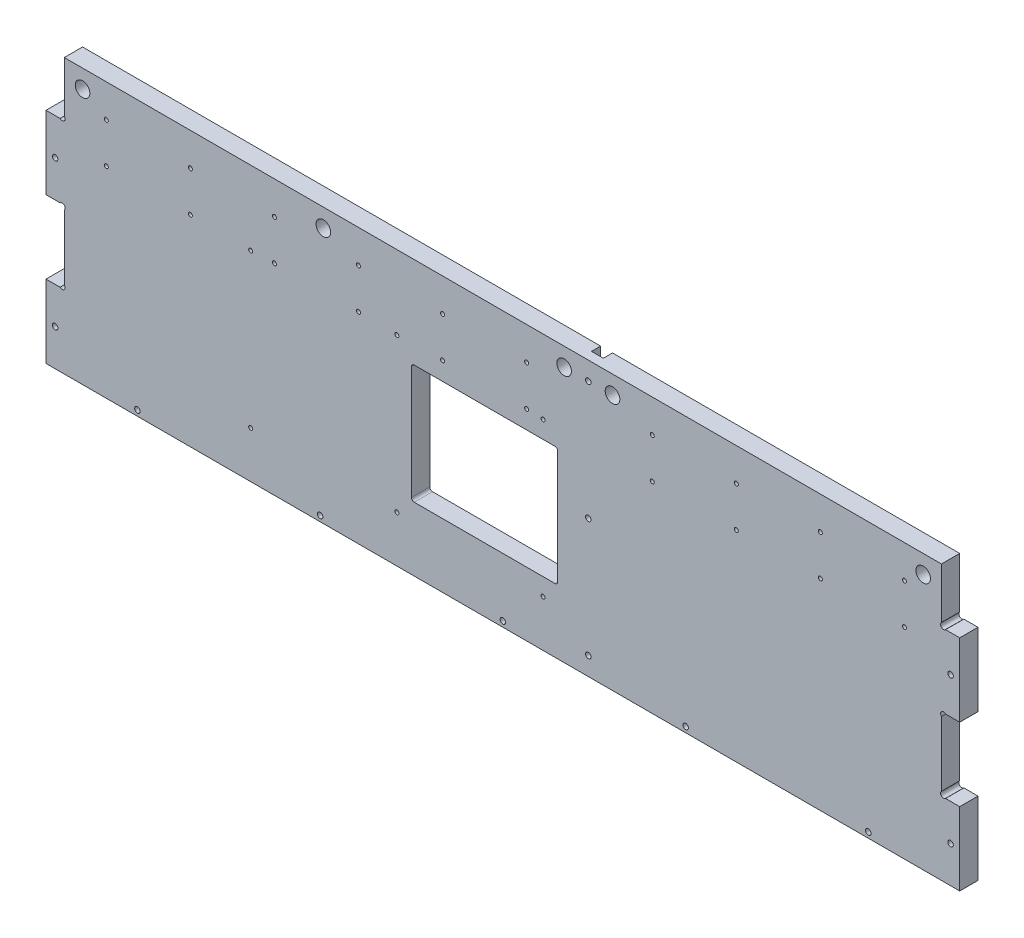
ISO-10303-21;
HEADER;
FILE_DESCRIPTION(('STEP AP214'),'2;1');
FILE_NAME('part.step','',(''),(''),'','','');
FILE_SCHEMA(('AUTOMOTIVE_DESIGN { 1 0 10303 214 1 1 1 1 }'));
ENDSEC;
DATA;
#1=APPLICATION_CONTEXT('core data for automotive mechanical design processes');
#2=APPLICATION_PROTOCOL_DEFINITION('international standard','automotive_design',2000,#1);
#3=PRODUCT_CONTEXT('',#1,'mechanical');
#4=PRODUCT('Part','Part','',(#3));
#5=PRODUCT_RELATED_PRODUCT_CATEGORY('part','',(#4));
#6=PRODUCT_DEFINITION_FORMATION('','',#4);
#7=PRODUCT_DEFINITION_CONTEXT('part definition',#1,'design');
#8=PRODUCT_DEFINITION('design','',#6,#7);
#9=PRODUCT_DEFINITION_SHAPE('','',#8);
#10=(LENGTH_UNIT() NAMED_UNIT(*) SI_UNIT(.MILLI.,.METRE.));
#11=(NAMED_UNIT(*) PLANE_ANGLE_UNIT() SI_UNIT($,.RADIAN.));
#12=(NAMED_UNIT(*) SI_UNIT($,.STERADIAN.) SOLID_ANGLE_UNIT());
#13=UNCERTAINTY_MEASURE_WITH_UNIT(LENGTH_MEASURE(1.E-05),#10,'distance_accuracy_value','');
#14=(GEOMETRIC_REPRESENTATION_CONTEXT(3) GLOBAL_UNCERTAINTY_ASSIGNED_CONTEXT((#13)) GLOBAL_UNIT_ASSIGNED_CONTEXT((#10,
#11,#12)) REPRESENTATION_CONTEXT('',''));
#15=CARTESIAN_POINT('',(0.,0.,0.));
#16=DIRECTION('',(0.,0.,1.));
#17=DIRECTION('',(1.,0.,0.));
#18=AXIS2_PLACEMENT_3D('',#15,#16,#17);
#19=CARTESIAN_POINT('',(0.,0.,0.));
#20=DIRECTION('',(0.,0.,1.));
#21=DIRECTION('',(1.,0.,0.));
#22=AXIS2_PLACEMENT_3D('',#19,#20,#21);
#23=PLANE('',#22);
#24=CARTESIAN_POINT('',(272.,25.5,0.));
#25=DIRECTION('',(0.,0.,-1.));
#26=DIRECTION('',(-1.,0.,0.));
#27=AXIS2_PLACEMENT_3D('',#24,#25,#26);
#28=CIRCLE('',#27,1.09999999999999);
#29=CARTESIAN_POINT('',(270.9,25.5,0.));
#30=VERTEX_POINT('',#29);
#31=EDGE_CURVE('E1225',#30,#30,#28,.T.);
#32=ORIENTED_EDGE('',*,*,#31,.F.);
#33=EDGE_LOOP('',(#32));
#34=FACE_BOUND('',#33,.T.);
#35=CARTESIAN_POINT('',(192.,25.5,0.));
#36=DIRECTION('',(0.,0.,-1.));
#37=DIRECTION('',(-1.,0.,0.));
#38=AXIS2_PLACEMENT_3D('',#35,#36,#37);
#39=CIRCLE('',#38,1.09999999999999);
#40=CARTESIAN_POINT('',(190.9,25.5,0.));
#41=VERTEX_POINT('',#40);
#42=EDGE_CURVE('E1227',#41,#41,#39,.T.);
#43=ORIENTED_EDGE('',*,*,#42,.F.);
#44=EDGE_LOOP('',(#43));
#45=FACE_BOUND('',#44,.T.);
#46=CARTESIAN_POINT('',(112.,25.5,0.));
#47=DIRECTION('',(0.,0.,-1.));
#48=DIRECTION('',(-1.,0.,0.));
#49=AXIS2_PLACEMENT_3D('',#46,#47,#48);
#50=CIRCLE('',#49,1.10000000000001);
#51=CARTESIAN_POINT('',(110.9,25.5,0.));
#52=VERTEX_POINT('',#51);
#53=EDGE_CURVE('E1235',#52,#52,#50,.T.);
#54=ORIENTED_EDGE('',*,*,#53,.F.);
#55=EDGE_LOOP('',(#54));
#56=FACE_BOUND('',#55,.T.);
#57=CARTESIAN_POINT('',(112.,109.5,0.));
#58=DIRECTION('',(0.,0.,-1.));
#59=DIRECTION('',(-1.,0.,0.));
#60=AXIS2_PLACEMENT_3D('',#57,#58,#59);
#61=CIRCLE('',#60,1.10000000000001);
#62=CARTESIAN_POINT('',(110.9,109.5,0.));
#63=VERTEX_POINT('',#62);
#64=EDGE_CURVE('E1241',#63,#63,#61,.T.);
#65=ORIENTED_EDGE('',*,*,#64,.F.);
#66=EDGE_LOOP('',(#65));
#67=FACE_BOUND('',#66,.T.);
#68=CARTESIAN_POINT('',(192.,109.5,0.));
#69=DIRECTION('',(0.,0.,-1.));
#70=DIRECTION('',(-1.,0.,0.));
#71=AXIS2_PLACEMENT_3D('',#68,#69,#70);
#72=CIRCLE('',#71,1.09999999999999);
#73=CARTESIAN_POINT('',(190.9,109.5,0.));
#74=VERTEX_POINT('',#73);
#75=EDGE_CURVE('E1247',#74,#74,#72,.T.);
#76=ORIENTED_EDGE('',*,*,#75,.F.);
#77=EDGE_LOOP('',(#76));
#78=FACE_BOUND('',#77,.T.);
#79=CARTESIAN_POINT('',(272.,109.5,0.));
#80=DIRECTION('',(0.,0.,-1.));
#81=DIRECTION('',(-1.,0.,0.));
#82=AXIS2_PLACEMENT_3D('',#79,#80,#81);
#83=CIRCLE('',#82,1.09999999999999);
#84=CARTESIAN_POINT('',(270.9,109.5,0.));
#85=VERTEX_POINT('',#84);
#86=EDGE_CURVE('E1253',#85,#85,#83,.T.);
#87=ORIENTED_EDGE('',*,*,#86,.F.);
#88=EDGE_LOOP('',(#87));
#89=FACE_BOUND('',#88,.T.);
#90=CARTESIAN_POINT('',(79.0000000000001,110.,0.));
#91=DIRECTION('',(0.,0.,-1.));
#92=DIRECTION('',(-1.,0.,0.));
#93=AXIS2_PLACEMENT_3D('',#90,#91,#92);
#94=CIRCLE('',#93,1.10000000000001);
#95=CARTESIAN_POINT('',(77.9,110.,0.));
#96=VERTEX_POINT('',#95);
#97=EDGE_CURVE('E1291',#96,#96,#94,.T.);
#98=ORIENTED_EDGE('',*,*,#97,.F.);
#99=EDGE_LOOP('',(#98));
#100=FACE_BOUND('',#99,.T.);
#101=CARTESIAN_POINT('',(79.0000000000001,132.,0.));
#102=DIRECTION('',(0.,0.,-1.));
#103=DIRECTION('',(-1.,0.,0.));
#104=AXIS2_PLACEMENT_3D('',#101,#102,#103);
#105=CIRCLE('',#104,1.1);
#106=CARTESIAN_POINT('',(77.9,132.,0.));
#107=VERTEX_POINT('',#106);
#108=EDGE_CURVE('E1297',#107,#107,#105,.T.);
#109=ORIENTED_EDGE('',*,*,#108,.F.);
#110=EDGE_LOOP('',(#109));
#111=FACE_BOUND('',#110,.T.);
#112=CARTESIAN_POINT('',(33.0000000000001,132.,0.));
#113=DIRECTION('',(0.,0.,-1.));
#114=DIRECTION('',(-1.,0.,0.));
#115=AXIS2_PLACEMENT_3D('',#112,#113,#114);
#116=CIRCLE('',#115,1.1);
#117=CARTESIAN_POINT('',(31.9000000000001,132.,0.));
#118=VERTEX_POINT('',#117);
#119=EDGE_CURVE('E1303',#118,#118,#116,.T.);
#120=ORIENTED_EDGE('',*,*,#119,.F.);
#121=EDGE_LOOP('',(#120));
#122=FACE_BOUND('',#121,.T.);
#123=CARTESIAN_POINT('',(33.0000000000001,110.,0.));
#124=DIRECTION('',(0.,0.,-1.));
#125=DIRECTION('',(-1.,0.,0.));
#126=AXIS2_PLACEMENT_3D('',#123,#124,#125);
#127=CIRCLE('',#126,1.1);
#128=CARTESIAN_POINT('',(31.9000000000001,110.,0.));
#129=VERTEX_POINT('',#128);
#130=EDGE_CURVE('E1309',#129,#129,#127,.T.);
#131=ORIENTED_EDGE('',*,*,#130,.F.);
#132=EDGE_LOOP('',(#131));
#133=FACE_BOUND('',#132,.T.);
#134=CARTESIAN_POINT('',(125.,110.,0.));
#135=DIRECTION('',(0.,0.,-1.));
#136=DIRECTION('',(-1.,0.,0.));
#137=AXIS2_PLACEMENT_3D('',#134,#135,#136);
#138=CIRCLE('',#137,1.10000000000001);
#139=CARTESIAN_POINT('',(123.9,110.,0.));
#140=VERTEX_POINT('',#139);
#141=EDGE_CURVE('E1315',#140,#140,#138,.T.);
#142=ORIENTED_EDGE('',*,*,#141,.F.);
#143=EDGE_LOOP('',(#142));
#144=FACE_BOUND('',#143,.T.);
#145=CARTESIAN_POINT('',(125.,132.,0.));
#146=DIRECTION('',(0.,0.,-1.));
#147=DIRECTION('',(-1.,0.,0.));
#148=AXIS2_PLACEMENT_3D('',#145,#146,#147);
#149=CIRCLE('',#148,1.1);
#150=CARTESIAN_POINT('',(123.9,132.,0.));
#151=VERTEX_POINT('',#150);
#152=EDGE_CURVE('E1321',#151,#151,#149,.T.);
#153=ORIENTED_EDGE('',*,*,#152,.F.);
#154=EDGE_LOOP('',(#153));
#155=FACE_BOUND('',#154,.T.);
#156=CARTESIAN_POINT('',(171.,110.,0.));
#157=DIRECTION('',(0.,0.,-1.));
#158=DIRECTION('',(-1.,0.,0.));
#159=AXIS2_PLACEMENT_3D('',#156,#157,#158);
#160=CIRCLE('',#159,1.09999999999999);
#161=CARTESIAN_POINT('',(169.9,110.,0.));
#162=VERTEX_POINT('',#161);
#163=EDGE_CURVE('E1327',#162,#162,#160,.T.);
#164=ORIENTED_EDGE('',*,*,#163,.F.);
#165=EDGE_LOOP('',(#164));
#166=FACE_BOUND('',#165,.T.);
#167=CARTESIAN_POINT('',(171.,132.,0.));
#168=DIRECTION('',(0.,0.,-1.));
#169=DIRECTION('',(-1.,0.,0.));
#170=AXIS2_PLACEMENT_3D('',#167,#168,#169);
#171=CIRCLE('',#170,1.09999999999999);
#172=CARTESIAN_POINT('',(169.9,132.,0.));
#173=VERTEX_POINT('',#172);
#174=EDGE_CURVE('E1333',#173,#173,#171,.T.);
#175=ORIENTED_EDGE('',*,*,#174,.F.);
#176=EDGE_LOOP('',(#175));
#177=FACE_BOUND('',#176,.T.);
#178=CARTESIAN_POINT('',(217.,110.,0.));
#179=DIRECTION('',(0.,0.,-1.));
#180=DIRECTION('',(-1.,0.,0.));
#181=AXIS2_PLACEMENT_3D('',#178,#179,#180);
#182=CIRCLE('',#181,1.09999999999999);
#183=CARTESIAN_POINT('',(215.9,110.,0.));
#184=VERTEX_POINT('',#183);
#185=EDGE_CURVE('E1339',#184,#184,#182,.T.);
#186=ORIENTED_EDGE('',*,*,#185,.F.);
#187=EDGE_LOOP('',(#186));
#188=FACE_BOUND('',#187,.T.);
#189=CARTESIAN_POINT('',(263.,110.,0.));
#190=DIRECTION('',(0.,0.,-1.));
#191=DIRECTION('',(-1.,0.,0.));
#192=AXIS2_PLACEMENT_3D('',#189,#190,#191);
#193=CIRCLE('',#192,1.09999999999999);
#194=CARTESIAN_POINT('',(261.9,110.,0.));
#195=VERTEX_POINT('',#194);
#196=EDGE_CURVE('E1345',#195,#195,#193,.T.);
#197=ORIENTED_EDGE('',*,*,#196,.F.);
#198=EDGE_LOOP('',(#197));
#199=FACE_BOUND('',#198,.T.);
#200=CARTESIAN_POINT('',(217.,132.,0.));
#201=DIRECTION('',(0.,0.,-1.));
#202=DIRECTION('',(-1.,0.,0.));
#203=AXIS2_PLACEMENT_3D('',#200,#201,#202);
#204=CIRCLE('',#203,1.09999999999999);
#205=CARTESIAN_POINT('',(215.9,132.,0.));
#206=VERTEX_POINT('',#205);
#207=EDGE_CURVE('E1351',#206,#206,#204,.T.);
#208=ORIENTED_EDGE('',*,*,#207,.F.);
#209=EDGE_LOOP('',(#208));
#210=FACE_BOUND('',#209,.T.);
#211=CARTESIAN_POINT('',(263.,132.,0.));
#212=DIRECTION('',(0.,0.,-1.));
#213=DIRECTION('',(-1.,0.,0.));
#214=AXIS2_PLACEMENT_3D('',#211,#212,#213);
#215=CIRCLE('',#214,1.09999999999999);
#216=CARTESIAN_POINT('',(261.9,132.,0.));
#217=VERTEX_POINT('',#216);
#218=EDGE_CURVE('E1357',#217,#217,#215,.T.);
#219=ORIENTED_EDGE('',*,*,#218,.F.);
#220=EDGE_LOOP('',(#219));
#221=FACE_BOUND('',#220,.T.);
#222=CARTESIAN_POINT('',(151.75,140.,0.));
#223=DIRECTION('',(0.,0.,1.));
#224=DIRECTION('',(1.,0.,0.));
#225=AXIS2_PLACEMENT_3D('',#222,#223,#224);
#226=CIRCLE('',#225,3.99999999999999);
#227=CARTESIAN_POINT('',(155.75,140.,0.));
#228=VERTEX_POINT('',#227);
#229=EDGE_CURVE('E1384',#228,#228,#226,.T.);
#230=ORIENTED_EDGE('',*,*,#229,.T.);
#231=EDGE_LOOP('',(#230));
#232=FACE_BOUND('',#231,.T.);
#233=CARTESIAN_POINT('',(283.5,140.,0.));
#234=DIRECTION('',(0.,0.,1.));
#235=DIRECTION('',(1.,0.,0.));
#236=AXIS2_PLACEMENT_3D('',#233,#234,#235);
#237=CIRCLE('',#236,3.99999999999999);
#238=CARTESIAN_POINT('',(287.5,140.,0.));
#239=VERTEX_POINT('',#238);
#240=EDGE_CURVE('E1390',#239,#239,#237,.T.);
#241=ORIENTED_EDGE('',*,*,#240,.T.);
#242=EDGE_LOOP('',(#241));
#243=FACE_BOUND('',#242,.T.);
#244=CARTESIAN_POINT('',(20.,140.,0.));
#245=DIRECTION('',(0.,0.,1.));
#246=DIRECTION('',(1.,0.,0.));
#247=AXIS2_PLACEMENT_3D('',#244,#245,#246);
#248=CIRCLE('',#247,4.00000000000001);
#249=CARTESIAN_POINT('',(24.,140.,0.));
#250=VERTEX_POINT('',#249);
#251=EDGE_CURVE('E1400',#250,#250,#248,.T.);
#252=ORIENTED_EDGE('',*,*,#251,.T.);
#253=EDGE_LOOP('',(#252));
#254=FACE_BOUND('',#253,.T.);
#255=CARTESIAN_POINT('',(5.,20.,0.));
#256=DIRECTION('',(0.,0.,1.));
#257=DIRECTION('',(1.,0.,0.));
#258=AXIS2_PLACEMENT_3D('',#255,#256,#257);
#259=CIRCLE('',#258,1.5);
#260=CARTESIAN_POINT('',(6.5,20.,0.));
#261=VERTEX_POINT('',#260);
#262=EDGE_CURVE('E573',#261,#261,#259,.T.);
#263=ORIENTED_EDGE('',*,*,#262,.T.);
#264=EDGE_LOOP('',(#263));
#265=FACE_BOUND('',#264,.T.);
#266=CARTESIAN_POINT('',(5.,100.,0.));
#267=DIRECTION('',(0.,0.,1.));
#268=DIRECTION('',(1.,0.,0.));
#269=AXIS2_PLACEMENT_3D('',#266,#267,#268);
#270=CIRCLE('',#269,1.5);
#271=CARTESIAN_POINT('',(6.5,100.,0.));
#272=VERTEX_POINT('',#271);
#273=EDGE_CURVE('E562',#272,#272,#270,.T.);
#274=ORIENTED_EDGE('',*,*,#273,.T.);
#275=EDGE_LOOP('',(#274));
#276=FACE_BOUND('',#275,.T.);
#277=CARTESIAN_POINT('',(250.,3.00000000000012,0.));
#278=DIRECTION('',(0.,0.,1.));
#279=DIRECTION('',(1.,0.,0.));
#280=AXIS2_PLACEMENT_3D('',#277,#278,#279);
#281=CIRCLE('',#280,1.50000000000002);
#282=CARTESIAN_POINT('',(251.5,3.00000000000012,0.));
#283=VERTEX_POINT('',#282);
#284=EDGE_CURVE('E746',#283,#283,#281,.T.);
#285=ORIENTED_EDGE('',*,*,#284,.T.);
#286=EDGE_LOOP('',(#285));
#287=FACE_BOUND('',#286,.T.);
#288=CARTESIAN_POINT('',(50.,3.00000000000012,0.));
#289=DIRECTION('',(0.,0.,1.));
#290=DIRECTION('',(1.,0.,0.));
#291=AXIS2_PLACEMENT_3D('',#288,#289,#290);
#292=CIRCLE('',#291,1.5);
#293=CARTESIAN_POINT('',(51.5,3.00000000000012,0.));
#294=VERTEX_POINT('',#293);
#295=EDGE_CURVE('E740',#294,#294,#292,.T.);
#296=ORIENTED_EDGE('',*,*,#295,.T.);
#297=EDGE_LOOP('',(#296));
#298=FACE_BOUND('',#297,.T.);
#299=CARTESIAN_POINT('',(150.,3.00000000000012,0.));
#300=DIRECTION('',(0.,0.,1.));
#301=DIRECTION('',(1.,0.,0.));
#302=AXIS2_PLACEMENT_3D('',#299,#300,#301);
#303=CIRCLE('',#302,1.5);
#304=CARTESIAN_POINT('',(151.5,3.00000000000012,0.));
#305=VERTEX_POINT('',#304);
#306=EDGE_CURVE('E734',#305,#305,#303,.T.);
#307=ORIENTED_EDGE('',*,*,#306,.T.);
#308=EDGE_LOOP('',(#307));
#309=FACE_BOUND('',#308,.T.);
#310=DIRECTION('',(-1.,0.,0.));
#311=VECTOR('',#310,1.);
#312=CARTESIAN_POINT('',(201.5,100.,0.));
#313=LINE('',#312,#311);
#314=CARTESIAN_POINT('',(278.5,100.,0.));
#315=VERTEX_POINT('',#314);
#316=CARTESIAN_POINT('',(201.5,100.,0.));
#317=VERTEX_POINT('',#316);
#318=EDGE_CURVE('E704',#315,#317,#313,.T.);
#319=ORIENTED_EDGE('',*,*,#318,.T.);
#320=CARTESIAN_POINT('',(201.5,98.5,0.));
#321=DIRECTION('',(0.,0.,1.));
#322=DIRECTION('',(1.,0.,0.));
#323=AXIS2_PLACEMENT_3D('',#320,#321,#322);
#324=CIRCLE('',#323,1.5);
#325=CARTESIAN_POINT('',(200.,98.5,0.));
#326=VERTEX_POINT('',#325);
#327=EDGE_CURVE('E683',#317,#326,#324,.T.);
#328=ORIENTED_EDGE('',*,*,#327,.T.);
#329=DIRECTION('',(0.,-1.,0.));
#330=VECTOR('',#329,1.);
#331=CARTESIAN_POINT('',(200.,36.5,0.));
#332=LINE('',#331,#330);
#333=CARTESIAN_POINT('',(200.,36.5,0.));
#334=VERTEX_POINT('',#333);
#335=EDGE_CURVE('E686',#326,#334,#332,.T.);
#336=ORIENTED_EDGE('',*,*,#335,.T.);
#337=CARTESIAN_POINT('',(201.5,36.5,0.));
#338=DIRECTION('',(0.,0.,1.));
#339=DIRECTION('',(1.,0.,0.));
#340=AXIS2_PLACEMENT_3D('',#337,#338,#339);
#341=CIRCLE('',#340,1.5);
#342=CARTESIAN_POINT('',(201.5,35.,0.));
#343=VERTEX_POINT('',#342);
#344=EDGE_CURVE('E689',#334,#343,#341,.T.);
#345=ORIENTED_EDGE('',*,*,#344,.T.);
#346=DIRECTION('',(1.,0.,0.));
#347=VECTOR('',#346,1.);
#348=CARTESIAN_POINT('',(201.5,35.,0.));
#349=LINE('',#348,#347);
#350=CARTESIAN_POINT('',(278.5,35.,0.));
#351=VERTEX_POINT('',#350);
#352=EDGE_CURVE('E692',#343,#351,#349,.T.);
#353=ORIENTED_EDGE('',*,*,#352,.T.);
#354=CARTESIAN_POINT('',(278.5,36.5,0.));
#355=DIRECTION('',(0.,0.,1.));
#356=DIRECTION('',(-1.,0.,0.));
#357=AXIS2_PLACEMENT_3D('',#354,#355,#356);
#358=CIRCLE('',#357,1.5);
#359=CARTESIAN_POINT('',(280.,36.5,0.));
#360=VERTEX_POINT('',#359);
#361=EDGE_CURVE('E695',#351,#360,#358,.T.);
#362=ORIENTED_EDGE('',*,*,#361,.T.);
#363=DIRECTION('',(0.,1.,0.));
#364=VECTOR('',#363,1.);
#365=CARTESIAN_POINT('',(280.,36.5,0.));
#366=LINE('',#365,#364);
#367=CARTESIAN_POINT('',(280.,98.5,0.));
#368=VERTEX_POINT('',#367);
#369=EDGE_CURVE('E698',#360,#368,#366,.T.);
#370=ORIENTED_EDGE('',*,*,#369,.T.);
#371=CARTESIAN_POINT('',(278.5,98.5,0.));
#372=DIRECTION('',(0.,0.,1.));
#373=DIRECTION('',(1.,0.,0.));
#374=AXIS2_PLACEMENT_3D('',#371,#372,#373);
#375=CIRCLE('',#374,1.5);
#376=EDGE_CURVE('E701',#368,#315,#375,.T.);
#377=ORIENTED_EDGE('',*,*,#376,.T.);
#378=EDGE_LOOP('',(#319,#328,#336,#345,#353,#362,#370,#377));
#379=FACE_BOUND('',#378,.T.);
#380=DIRECTION('',(-1.,0.,0.));
#381=VECTOR('',#380,1.);
#382=CARTESIAN_POINT('',(490.,150.,0.));
#383=LINE('',#382,#381);
#384=CARTESIAN_POINT('',(293.5,150.,0.));
#385=VERTEX_POINT('',#384);
#386=CARTESIAN_POINT('',(10.,150.,0.));
#387=VERTEX_POINT('',#386);
#388=EDGE_CURVE('E263',#385,#387,#383,.T.);
#389=ORIENTED_EDGE('',*,*,#388,.F.);
#390=DIRECTION('',(0.,1.,0.));
#391=VECTOR('',#390,1.);
#392=CARTESIAN_POINT('',(293.5,150.,0.));
#393=LINE('',#392,#391);
#394=CARTESIAN_POINT('',(293.5,0.,0.));
#395=VERTEX_POINT('',#394);
#396=EDGE_CURVE('E246',#395,#385,#393,.T.);
#397=ORIENTED_EDGE('',*,*,#396,.F.);
#398=DIRECTION('',(1.,0.,0.));
#399=VECTOR('',#398,1.);
#400=CARTESIAN_POINT('',(0.,0.,0.));
#401=LINE('',#400,#399);
#402=CARTESIAN_POINT('',(0.,0.,0.));
#403=VERTEX_POINT('',#402);
#404=EDGE_CURVE('E435',#403,#395,#401,.T.);
#405=ORIENTED_EDGE('',*,*,#404,.F.);
#406=DIRECTION('',(0.,-1.,0.));
#407=VECTOR('',#406,1.);
#408=CARTESIAN_POINT('',(0.,40.,0.));
#409=LINE('',#408,#407);
#410=CARTESIAN_POINT('',(0.,40.,0.));
#411=VERTEX_POINT('',#410);
#412=EDGE_CURVE('E431',#411,#403,#409,.T.);
#413=ORIENTED_EDGE('',*,*,#412,.F.);
#414=DIRECTION('',(-1.,0.,0.));
#415=VECTOR('',#414,1.);
#416=CARTESIAN_POINT('',(10.,40.,0.));
#417=LINE('',#416,#415);
#418=CARTESIAN_POINT('',(7.7372583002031,40.,0.));
#419=VERTEX_POINT('',#418);
#420=EDGE_CURVE('E292',#419,#411,#417,.T.);
#421=ORIENTED_EDGE('',*,*,#420,.F.);
#422=CARTESIAN_POINT('',(8.86862915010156,41.1313708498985,0.));
#423=DIRECTION('',(0.,0.,1.));
#424=DIRECTION('',(1.,0.,0.));
#425=AXIS2_PLACEMENT_3D('',#422,#423,#424);
#426=CIRCLE('',#425,1.6);
#427=CARTESIAN_POINT('',(10.,42.262741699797,0.));
#428=VERTEX_POINT('',#427);
#429=EDGE_CURVE('E365',#419,#428,#426,.T.);
#430=ORIENTED_EDGE('',*,*,#429,.T.);
#431=DIRECTION('',(0.,-1.,0.));
#432=VECTOR('',#431,1.);
#433=CARTESIAN_POINT('',(10.,80.0000000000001,0.));
#434=LINE('',#433,#432);
#435=CARTESIAN_POINT('',(10.,77.7372583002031,0.));
#436=VERTEX_POINT('',#435);
#437=EDGE_CURVE('E289',#436,#428,#434,.T.);
#438=ORIENTED_EDGE('',*,*,#437,.F.);
#439=CARTESIAN_POINT('',(8.86862915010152,78.8686291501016,0.));
#440=DIRECTION('',(0.,0.,1.));
#441=DIRECTION('',(1.,0.,0.));
#442=AXIS2_PLACEMENT_3D('',#439,#440,#441);
#443=CIRCLE('',#442,1.6);
#444=CARTESIAN_POINT('',(7.73725830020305,80.0000000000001,0.));
#445=VERTEX_POINT('',#444);
#446=EDGE_CURVE('E363',#436,#445,#443,.T.);
#447=ORIENTED_EDGE('',*,*,#446,.T.);
#448=DIRECTION('',(1.,0.,0.));
#449=VECTOR('',#448,1.);
#450=CARTESIAN_POINT('',(0.,80.0000000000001,0.));
#451=LINE('',#450,#449);
#452=CARTESIAN_POINT('',(0.,80.0000000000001,0.));
#453=VERTEX_POINT('',#452);
#454=EDGE_CURVE('E286',#453,#445,#451,.T.);
#455=ORIENTED_EDGE('',*,*,#454,.F.);
#456=DIRECTION('',(0.,-1.,0.));
#457=VECTOR('',#456,1.);
#458=CARTESIAN_POINT('',(0.,120.,0.));
#459=LINE('',#458,#457);
#460=CARTESIAN_POINT('',(0.,120.,0.));
#461=VERTEX_POINT('',#460);
#462=EDGE_CURVE('E284',#461,#453,#459,.T.);
#463=ORIENTED_EDGE('',*,*,#462,.F.);
#464=DIRECTION('',(-1.,0.,0.));
#465=VECTOR('',#464,1.);
#466=CARTESIAN_POINT('',(10.,120.,0.));
#467=LINE('',#466,#465);
#468=CARTESIAN_POINT('',(7.73725830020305,120.,0.));
#469=VERTEX_POINT('',#468);
#470=EDGE_CURVE('E282',#469,#461,#467,.T.);
#471=ORIENTED_EDGE('',*,*,#470,.F.);
#472=CARTESIAN_POINT('',(8.86862915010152,121.131370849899,0.));
#473=DIRECTION('',(0.,0.,1.));
#474=DIRECTION('',(1.,0.,0.));
#475=AXIS2_PLACEMENT_3D('',#472,#473,#474);
#476=CIRCLE('',#475,1.6);
#477=CARTESIAN_POINT('',(10.,122.262741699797,0.));
#478=VERTEX_POINT('',#477);
#479=EDGE_CURVE('E361',#469,#478,#476,.T.);
#480=ORIENTED_EDGE('',*,*,#479,.T.);
#481=DIRECTION('',(0.,-1.,0.));
#482=VECTOR('',#481,1.);
#483=CARTESIAN_POINT('',(10.,150.,0.));
#484=LINE('',#483,#482);
#485=EDGE_CURVE('E272',#387,#478,#484,.T.);
#486=ORIENTED_EDGE('',*,*,#485,.F.);
#487=EDGE_LOOP('',(#389,#397,#405,#413,#421,#430,#438,#447,#455,#463,#471,#480,#486));
#488=FACE_BOUND('',#487,.T.);
#489=ADVANCED_FACE('F26',(#34,#45,#56,#67,#78,#89,#100,#111,#122,#133,#144,#155,#166,#177,#188,
#199,#210,#221,#232,#243,#254,#265,#276,#287,#298,#309,#379,#488),#23,.F.);
#490=CARTESIAN_POINT('',(0.,40.,10.));
#491=DIRECTION('',(1.,0.,0.));
#492=DIRECTION('',(0.,0.,-1.));
#493=AXIS2_PLACEMENT_3D('',#490,#491,#492);
#494=PLANE('',#493);
#495=ORIENTED_EDGE('',*,*,#412,.T.);
#496=DIRECTION('',(0.,0.,-1.));
#497=VECTOR('',#496,1.);
#498=CARTESIAN_POINT('',(0.,0.,10.));
#499=LINE('',#498,#497);
#500=CARTESIAN_POINT('',(0.,0.,10.));
#501=VERTEX_POINT('',#500);
#502=EDGE_CURVE('E358',#501,#403,#499,.T.);
#503=ORIENTED_EDGE('',*,*,#502,.F.);
#504=DIRECTION('',(0.,-1.,0.));
#505=VECTOR('',#504,1.);
#506=CARTESIAN_POINT('',(0.,40.,10.));
#507=LINE('',#506,#505);
#508=CARTESIAN_POINT('',(0.,40.,10.));
#509=VERTEX_POINT('',#508);
#510=EDGE_CURVE('E294',#509,#501,#507,.T.);
#511=ORIENTED_EDGE('',*,*,#510,.F.);
#512=DIRECTION('',(0.,0.,-1.));
#513=VECTOR('',#512,1.);
#514=CARTESIAN_POINT('',(0.,40.,10.));
#515=LINE('',#514,#513);
#516=EDGE_CURVE('E332',#509,#411,#515,.T.);
#517=ORIENTED_EDGE('',*,*,#516,.T.);
#518=EDGE_LOOP('',(#495,#503,#511,#517));
#519=FACE_BOUND('',#518,.T.);
#520=ADVANCED_FACE('F28',(#519),#494,.F.);
#521=CARTESIAN_POINT('',(0.,0.,10.));
#522=DIRECTION('',(0.,1.,0.));
#523=DIRECTION('',(0.,0.,1.));
#524=AXIS2_PLACEMENT_3D('',#521,#522,#523);
#525=PLANE('',#524);
#526=ORIENTED_EDGE('',*,*,#404,.T.);
#527=DIRECTION('',(0.,0.,-1.));
#528=VECTOR('',#527,1.);
#529=CARTESIAN_POINT('',(293.5,0.,5.));
#530=LINE('',#529,#528);
#531=CARTESIAN_POINT('',(293.5,0.,5.));
#532=VERTEX_POINT('',#531);
#533=EDGE_CURVE('E252',#532,#395,#530,.T.);
#534=ORIENTED_EDGE('',*,*,#533,.F.);
#535=DIRECTION('',(-1.,0.,0.));
#536=VECTOR('',#535,1.);
#537=CARTESIAN_POINT('',(293.5,0.,5.));
#538=LINE('',#537,#536);
#539=CARTESIAN_POINT('',(300.,0.,5.));
#540=VERTEX_POINT('',#539);
#541=EDGE_CURVE('E267',#540,#532,#538,.T.);
#542=ORIENTED_EDGE('',*,*,#541,.F.);
#543=DIRECTION('',(0.,0.,-1.));
#544=VECTOR('',#543,1.);
#545=CARTESIAN_POINT('',(300.,0.,5.));
#546=LINE('',#545,#544);
#547=CARTESIAN_POINT('',(300.,0.,0.));
#548=VERTEX_POINT('',#547);
#549=EDGE_CURVE('E658',#540,#548,#546,.T.);
#550=ORIENTED_EDGE('',*,*,#549,.T.);
#551=CARTESIAN_POINT('',(500.,0.,0.));
#552=VERTEX_POINT('',#551);
#553=EDGE_CURVE('E434',#548,#552,#401,.T.);
#554=ORIENTED_EDGE('',*,*,#553,.T.);
#555=DIRECTION('',(0.,0.,-1.));
#556=VECTOR('',#555,1.);
#557=CARTESIAN_POINT('',(500.,0.,10.));
#558=LINE('',#557,#556);
#559=CARTESIAN_POINT('',(500.,0.,10.));
#560=VERTEX_POINT('',#559);
#561=EDGE_CURVE('E355',#560,#552,#558,.T.);
#562=ORIENTED_EDGE('',*,*,#561,.F.);
#563=DIRECTION('',(1.,0.,0.));
#564=VECTOR('',#563,1.);
#565=CARTESIAN_POINT('',(0.,0.,10.));
#566=LINE('',#565,#564);
#567=EDGE_CURVE('E297',#501,#560,#566,.T.);
#568=ORIENTED_EDGE('',*,*,#567,.F.);
#569=ORIENTED_EDGE('',*,*,#502,.T.);
#570=EDGE_LOOP('',(#526,#534,#542,#550,#554,#562,#568,#569));
#571=FACE_BOUND('',#570,.T.);
#572=ADVANCED_FACE('F485',(#571),#525,.F.);
#573=CARTESIAN_POINT('',(500.,0.,10.));
#574=DIRECTION('',(-1.,0.,0.));
#575=DIRECTION('',(0.,0.,1.));
#576=AXIS2_PLACEMENT_3D('',#573,#574,#575);
#577=PLANE('',#576);
#578=DIRECTION('',(0.,1.,0.));
#579=VECTOR('',#578,1.);
#580=CARTESIAN_POINT('',(500.,0.,0.));
#581=LINE('',#580,#579);
#582=CARTESIAN_POINT('',(500.,40.0000000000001,0.));
#583=VERTEX_POINT('',#582);
#584=EDGE_CURVE('E437',#552,#583,#581,.T.);
#585=ORIENTED_EDGE('',*,*,#584,.T.);
#586=DIRECTION('',(0.,0.,-1.));
#587=VECTOR('',#586,1.);
#588=CARTESIAN_POINT('',(500.,40.0000000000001,10.));
#589=LINE('',#588,#587);
#590=CARTESIAN_POINT('',(500.,40.0000000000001,10.));
#591=VERTEX_POINT('',#590);
#592=EDGE_CURVE('E352',#591,#583,#589,.T.);
#593=ORIENTED_EDGE('',*,*,#592,.F.);
#594=DIRECTION('',(0.,1.,0.));
#595=VECTOR('',#594,1.);
#596=CARTESIAN_POINT('',(500.,0.,10.));
#597=LINE('',#596,#595);
#598=EDGE_CURVE('E299',#560,#591,#597,.T.);
#599=ORIENTED_EDGE('',*,*,#598,.F.);
#600=ORIENTED_EDGE('',*,*,#561,.T.);
#601=EDGE_LOOP('',(#585,#593,#599,#600));
#602=FACE_BOUND('',#601,.T.);
#603=ADVANCED_FACE('F591',(#602),#577,.F.);
#604=CARTESIAN_POINT('',(500.,40.0000000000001,10.));
#605=DIRECTION('',(0.,-1.,0.));
#606=DIRECTION('',(1.,0.,0.));
#607=AXIS2_PLACEMENT_3D('',#604,#605,#606);
#608=PLANE('',#607);
#609=DIRECTION('',(-1.,0.,0.));
#610=VECTOR('',#609,1.);
#611=CARTESIAN_POINT('',(500.,40.0000000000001,0.));
#612=LINE('',#611,#610);
#613=CARTESIAN_POINT('',(492.262741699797,40.0000000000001,0.));
#614=VERTEX_POINT('',#613);
#615=EDGE_CURVE('E439',#583,#614,#612,.T.);
#616=ORIENTED_EDGE('',*,*,#615,.T.);
#617=DIRECTION('',(0.,0.,1.));
#618=VECTOR('',#617,1.);
#619=CARTESIAN_POINT('',(492.262741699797,40.0000000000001,0.));
#620=LINE('',#619,#618);
#621=CARTESIAN_POINT('',(492.262741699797,40.,10.));
#622=VERTEX_POINT('',#621);
#623=EDGE_CURVE('E396',#614,#622,#620,.T.);
#624=ORIENTED_EDGE('',*,*,#623,.T.);
#625=DIRECTION('',(-1.,0.,0.));
#626=VECTOR('',#625,1.);
#627=CARTESIAN_POINT('',(500.,40.0000000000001,10.));
#628=LINE('',#627,#626);
#629=EDGE_CURVE('E301',#591,#622,#628,.T.);
#630=ORIENTED_EDGE('',*,*,#629,.F.);
#631=ORIENTED_EDGE('',*,*,#592,.T.);
#632=EDGE_LOOP('',(#616,#624,#630,#631));
#633=FACE_BOUND('',#632,.T.);
#634=ADVANCED_FACE('F583',(#633),#608,.F.);
#635=CARTESIAN_POINT('',(490.,40.0000000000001,10.));
#636=DIRECTION('',(-1.,0.,0.));
#637=DIRECTION('',(0.,0.,1.));
#638=AXIS2_PLACEMENT_3D('',#635,#636,#637);
#639=PLANE('',#638);
#640=DIRECTION('',(0.,1.,0.));
#641=VECTOR('',#640,1.);
#642=CARTESIAN_POINT('',(490.,40.0000000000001,10.));
#643=LINE('',#642,#641);
#644=CARTESIAN_POINT('',(490.,42.2627416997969,10.));
#645=VERTEX_POINT('',#644);
#646=CARTESIAN_POINT('',(490.,77.7372583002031,10.));
#647=VERTEX_POINT('',#646);
#648=EDGE_CURVE('E304',#645,#647,#643,.T.);
#649=ORIENTED_EDGE('',*,*,#648,.F.);
#650=DIRECTION('',(0.,0.,1.));
#651=VECTOR('',#650,1.);
#652=CARTESIAN_POINT('',(490.,42.2627416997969,0.));
#653=LINE('',#652,#651);
#654=CARTESIAN_POINT('',(490.,42.2627416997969,0.));
#655=VERTEX_POINT('',#654);
#656=EDGE_CURVE('E578',#645,#655,#653,.F.);
#657=ORIENTED_EDGE('',*,*,#656,.T.);
#658=DIRECTION('',(0.,1.,0.));
#659=VECTOR('',#658,1.);
#660=CARTESIAN_POINT('',(490.,40.0000000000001,0.));
#661=LINE('',#660,#659);
#662=CARTESIAN_POINT('',(490.,77.7372583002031,0.));
#663=VERTEX_POINT('',#662);
#664=EDGE_CURVE('E376',#655,#663,#661,.T.);
#665=ORIENTED_EDGE('',*,*,#664,.T.);
#666=DIRECTION('',(0.,0.,1.));
#667=VECTOR('',#666,1.);
#668=CARTESIAN_POINT('',(490.,77.7372583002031,0.));
#669=LINE('',#668,#667);
#670=EDGE_CURVE('E388',#663,#647,#669,.T.);
#671=ORIENTED_EDGE('',*,*,#670,.T.);
#672=EDGE_LOOP('',(#649,#657,#665,#671));
#673=FACE_BOUND('',#672,.T.);
#674=ADVANCED_FACE('F475',(#673),#639,.F.);
#675=CARTESIAN_POINT('',(490.,80.0000000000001,10.));
#676=DIRECTION('',(0.,1.,0.));
#677=DIRECTION('',(0.,0.,1.));
#678=AXIS2_PLACEMENT_3D('',#675,#676,#677);
#679=PLANE('',#678);
#680=DIRECTION('',(1.,0.,0.));
#681=VECTOR('',#680,1.);
#682=CARTESIAN_POINT('',(490.,80.0000000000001,10.));
#683=LINE('',#682,#681);
#684=CARTESIAN_POINT('',(492.262741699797,80.0000000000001,10.));
#685=VERTEX_POINT('',#684);
#686=CARTESIAN_POINT('',(500.,80.0000000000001,10.));
#687=VERTEX_POINT('',#686);
#688=EDGE_CURVE('E306',#685,#687,#683,.T.);
#689=ORIENTED_EDGE('',*,*,#688,.F.);
#690=DIRECTION('',(0.,0.,1.));
#691=VECTOR('',#690,1.);
#692=CARTESIAN_POINT('',(492.262741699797,80.0000000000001,0.));
#693=LINE('',#692,#691);
#694=CARTESIAN_POINT('',(492.262741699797,80.0000000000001,0.));
#695=VERTEX_POINT('',#694);
#696=EDGE_CURVE('E385',#685,#695,#693,.F.);
#697=ORIENTED_EDGE('',*,*,#696,.T.);
#698=DIRECTION('',(1.,0.,0.));
#699=VECTOR('',#698,1.);
#700=CARTESIAN_POINT('',(490.,80.0000000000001,0.));
#701=LINE('',#700,#699);
#702=CARTESIAN_POINT('',(500.,80.0000000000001,0.));
#703=VERTEX_POINT('',#702);
#704=EDGE_CURVE('E378',#695,#703,#701,.T.);
#705=ORIENTED_EDGE('',*,*,#704,.T.);
#706=DIRECTION('',(0.,0.,-1.));
#707=VECTOR('',#706,1.);
#708=CARTESIAN_POINT('',(500.,80.0000000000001,10.));
#709=LINE('',#708,#707);
#710=EDGE_CURVE('E349',#687,#703,#709,.T.);
#711=ORIENTED_EDGE('',*,*,#710,.F.);
#712=EDGE_LOOP('',(#689,#697,#705,#711));
#713=FACE_BOUND('',#712,.T.);
#714=ADVANCED_FACE('F390',(#713),#679,.F.);
#715=CARTESIAN_POINT('',(500.,80.0000000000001,10.));
#716=DIRECTION('',(-1.,0.,0.));
#717=DIRECTION('',(0.,0.,1.));
#718=AXIS2_PLACEMENT_3D('',#715,#716,#717);
#719=PLANE('',#718);
#720=DIRECTION('',(0.,1.,0.));
#721=VECTOR('',#720,1.);
#722=CARTESIAN_POINT('',(500.,80.0000000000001,0.));
#723=LINE('',#722,#721);
#724=CARTESIAN_POINT('',(500.,120.,0.));
#725=VERTEX_POINT('',#724);
#726=EDGE_CURVE('E444',#703,#725,#723,.T.);
#727=ORIENTED_EDGE('',*,*,#726,.T.);
#728=DIRECTION('',(0.,0.,-1.));
#729=VECTOR('',#728,1.);
#730=CARTESIAN_POINT('',(500.,120.,10.));
#731=LINE('',#730,#729);
#732=CARTESIAN_POINT('',(500.,120.,10.));
#733=VERTEX_POINT('',#732);
#734=EDGE_CURVE('E346',#733,#725,#731,.T.);
#735=ORIENTED_EDGE('',*,*,#734,.F.);
#736=DIRECTION('',(0.,1.,0.));
#737=VECTOR('',#736,1.);
#738=CARTESIAN_POINT('',(500.,80.0000000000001,10.));
#739=LINE('',#738,#737);
#740=EDGE_CURVE('E308',#687,#733,#739,.T.);
#741=ORIENTED_EDGE('',*,*,#740,.F.);
#742=ORIENTED_EDGE('',*,*,#710,.T.);
#743=EDGE_LOOP('',(#727,#735,#741,#742));
#744=FACE_BOUND('',#743,.T.);
#745=ADVANCED_FACE('F465',(#744),#719,.F.);
#746=CARTESIAN_POINT('',(500.,120.,10.));
#747=DIRECTION('',(0.,-1.,0.));
#748=DIRECTION('',(0.,0.,-1.));
#749=AXIS2_PLACEMENT_3D('',#746,#747,#748);
#750=PLANE('',#749);
#751=DIRECTION('',(-1.,0.,0.));
#752=VECTOR('',#751,1.);
#753=CARTESIAN_POINT('',(500.,120.,0.));
#754=LINE('',#753,#752);
#755=CARTESIAN_POINT('',(492.262741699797,120.,0.));
#756=VERTEX_POINT('',#755);
#757=EDGE_CURVE('E277',#725,#756,#754,.T.);
#758=ORIENTED_EDGE('',*,*,#757,.T.);
#759=DIRECTION('',(0.,0.,1.));
#760=VECTOR('',#759,1.);
#761=CARTESIAN_POINT('',(492.262741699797,120.,0.));
#762=LINE('',#761,#760);
#763=CARTESIAN_POINT('',(492.262741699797,120.,10.));
#764=VERTEX_POINT('',#763);
#765=EDGE_CURVE('E404',#756,#764,#762,.T.);
#766=ORIENTED_EDGE('',*,*,#765,.T.);
#767=DIRECTION('',(-1.,0.,0.));
#768=VECTOR('',#767,1.);
#769=CARTESIAN_POINT('',(500.,120.,10.));
#770=LINE('',#769,#768);
#771=EDGE_CURVE('E310',#733,#764,#770,.T.);
#772=ORIENTED_EDGE('',*,*,#771,.F.);
#773=ORIENTED_EDGE('',*,*,#734,.T.);
#774=EDGE_LOOP('',(#758,#766,#772,#773));
#775=FACE_BOUND('',#774,.T.);
#776=ADVANCED_FACE('F448',(#775),#750,.F.);
#777=CARTESIAN_POINT('',(490.,120.,10.));
#778=DIRECTION('',(-1.,0.,0.));
#779=DIRECTION('',(0.,0.,1.));
#780=AXIS2_PLACEMENT_3D('',#777,#778,#779);
#781=PLANE('',#780);
#782=DIRECTION('',(0.,1.,0.));
#783=VECTOR('',#782,1.);
#784=CARTESIAN_POINT('',(490.,120.,10.));
#785=LINE('',#784,#783);
#786=CARTESIAN_POINT('',(490.,122.262741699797,10.));
#787=VERTEX_POINT('',#786);
#788=CARTESIAN_POINT('',(490.,150.,10.));
#789=VERTEX_POINT('',#788);
#790=EDGE_CURVE('E313',#787,#789,#785,.T.);
#791=ORIENTED_EDGE('',*,*,#790,.F.);
#792=DIRECTION('',(0.,0.,1.));
#793=VECTOR('',#792,1.);
#794=CARTESIAN_POINT('',(490.,122.262741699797,0.));
#795=LINE('',#794,#793);
#796=CARTESIAN_POINT('',(490.,122.262741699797,0.));
#797=VERTEX_POINT('',#796);
#798=EDGE_CURVE('E401',#787,#797,#795,.F.);
#799=ORIENTED_EDGE('',*,*,#798,.T.);
#800=DIRECTION('',(0.,1.,0.));
#801=VECTOR('',#800,1.);
#802=CARTESIAN_POINT('',(490.,120.,0.));
#803=LINE('',#802,#801);
#804=CARTESIAN_POINT('',(490.,150.,0.));
#805=VERTEX_POINT('',#804);
#806=EDGE_CURVE('E274',#797,#805,#803,.T.);
#807=ORIENTED_EDGE('',*,*,#806,.T.);
#808=DIRECTION('',(0.,0.,-1.));
#809=VECTOR('',#808,1.);
#810=CARTESIAN_POINT('',(490.,150.,10.));
#811=LINE('',#810,#809);
#812=EDGE_CURVE('E343',#789,#805,#811,.T.);
#813=ORIENTED_EDGE('',*,*,#812,.F.);
#814=EDGE_LOOP('',(#791,#799,#807,#813));
#815=FACE_BOUND('',#814,.T.);
#816=ADVANCED_FACE('F458',(#815),#781,.F.);
#817=CARTESIAN_POINT('',(490.,150.,10.));
#818=DIRECTION('',(0.,-1.,0.));
#819=DIRECTION('',(1.,0.,0.));
#820=AXIS2_PLACEMENT_3D('',#817,#818,#819);
#821=PLANE('',#820);
#822=DIRECTION('',(1.,0.,0.));
#823=VECTOR('',#822,1.);
#824=CARTESIAN_POINT('',(293.5,150.,5.));
#825=LINE('',#824,#823);
#826=CARTESIAN_POINT('',(293.5,150.,5.));
#827=VERTEX_POINT('',#826);
#828=CARTESIAN_POINT('',(300.,150.,5.));
#829=VERTEX_POINT('',#828);
#830=EDGE_CURVE('E266',#827,#829,#825,.T.);
#831=ORIENTED_EDGE('',*,*,#830,.F.);
#832=DIRECTION('',(0.,0.,-1.));
#833=VECTOR('',#832,1.);
#834=CARTESIAN_POINT('',(293.5,150.,5.));
#835=LINE('',#834,#833);
#836=EDGE_CURVE('E249',#827,#385,#835,.T.);
#837=ORIENTED_EDGE('',*,*,#836,.T.);
#838=ORIENTED_EDGE('',*,*,#388,.T.);
#839=DIRECTION('',(0.,0.,-1.));
#840=VECTOR('',#839,1.);
#841=CARTESIAN_POINT('',(10.,150.,10.));
#842=LINE('',#841,#840);
#843=CARTESIAN_POINT('',(10.,150.,10.));
#844=VERTEX_POINT('',#843);
#845=EDGE_CURVE('E341',#844,#387,#842,.T.);
#846=ORIENTED_EDGE('',*,*,#845,.F.);
#847=DIRECTION('',(-1.,0.,0.));
#848=VECTOR('',#847,1.);
#849=CARTESIAN_POINT('',(490.,150.,10.));
#850=LINE('',#849,#848);
#851=EDGE_CURVE('E315',#789,#844,#850,.T.);
#852=ORIENTED_EDGE('',*,*,#851,.F.);
#853=ORIENTED_EDGE('',*,*,#812,.T.);
#854=CARTESIAN_POINT('',(300.,150.,0.));
#855=VERTEX_POINT('',#854);
#856=EDGE_CURVE('E273',#805,#855,#383,.T.);
#857=ORIENTED_EDGE('',*,*,#856,.T.);
#858=DIRECTION('',(0.,0.,-1.));
#859=VECTOR('',#858,1.);
#860=CARTESIAN_POINT('',(300.,150.,5.));
#861=LINE('',#860,#859);
#862=EDGE_CURVE('E41',#829,#855,#861,.T.);
#863=ORIENTED_EDGE('',*,*,#862,.F.);
#864=EDGE_LOOP('',(#831,#837,#838,#846,#852,#853,#857,#863));
#865=FACE_BOUND('',#864,.T.);
#866=ADVANCED_FACE('F261',(#865),#821,.F.);
#867=CARTESIAN_POINT('',(10.,150.,10.));
#868=DIRECTION('',(1.,0.,0.));
#869=DIRECTION('',(0.,0.,-1.));
#870=AXIS2_PLACEMENT_3D('',#867,#868,#869);
#871=PLANE('',#870);
#872=ORIENTED_EDGE('',*,*,#485,.T.);
#873=DIRECTION('',(0.,0.,1.));
#874=VECTOR('',#873,1.);
#875=CARTESIAN_POINT('',(10.,122.262741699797,0.));
#876=LINE('',#875,#874);
#877=CARTESIAN_POINT('',(10.,122.262741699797,10.));
#878=VERTEX_POINT('',#877);
#879=EDGE_CURVE('E428',#478,#878,#876,.T.);
#880=ORIENTED_EDGE('',*,*,#879,.T.);
#881=DIRECTION('',(0.,-1.,0.));
#882=VECTOR('',#881,1.);
#883=CARTESIAN_POINT('',(10.,150.,10.));
#884=LINE('',#883,#882);
#885=EDGE_CURVE('E317',#844,#878,#884,.T.);
#886=ORIENTED_EDGE('',*,*,#885,.F.);
#887=ORIENTED_EDGE('',*,*,#845,.T.);
#888=EDGE_LOOP('',(#872,#880,#886,#887));
#889=FACE_BOUND('',#888,.T.);
#890=ADVANCED_FACE('F643',(#889),#871,.F.);
#891=CARTESIAN_POINT('',(10.,120.,10.));
#892=DIRECTION('',(0.,-1.,0.));
#893=DIRECTION('',(1.,0.,0.));
#894=AXIS2_PLACEMENT_3D('',#891,#892,#893);
#895=PLANE('',#894);
#896=DIRECTION('',(-1.,0.,0.));
#897=VECTOR('',#896,1.);
#898=CARTESIAN_POINT('',(10.,120.,10.));
#899=LINE('',#898,#897);
#900=CARTESIAN_POINT('',(7.73725830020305,120.,10.));
#901=VERTEX_POINT('',#900);
#902=CARTESIAN_POINT('',(0.,120.,10.));
#903=VERTEX_POINT('',#902);
#904=EDGE_CURVE('E320',#901,#903,#899,.T.);
#905=ORIENTED_EDGE('',*,*,#904,.F.);
#906=DIRECTION('',(0.,0.,1.));
#907=VECTOR('',#906,1.);
#908=CARTESIAN_POINT('',(7.73725830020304,120.,0.));
#909=LINE('',#908,#907);
#910=EDGE_CURVE('E425',#901,#469,#909,.F.);
#911=ORIENTED_EDGE('',*,*,#910,.T.);
#912=ORIENTED_EDGE('',*,*,#470,.T.);
#913=DIRECTION('',(0.,0.,-1.));
#914=VECTOR('',#913,1.);
#915=CARTESIAN_POINT('',(0.,120.,10.));
#916=LINE('',#915,#914);
#917=EDGE_CURVE('E338',#903,#461,#916,.T.);
#918=ORIENTED_EDGE('',*,*,#917,.F.);
#919=EDGE_LOOP('',(#905,#911,#912,#918));
#920=FACE_BOUND('',#919,.T.);
#921=ADVANCED_FACE('F640',(#920),#895,.F.);
#922=CARTESIAN_POINT('',(0.,120.,10.));
#923=DIRECTION('',(1.,0.,0.));
#924=DIRECTION('',(0.,1.,0.));
#925=AXIS2_PLACEMENT_3D('',#922,#923,#924);
#926=PLANE('',#925);
#927=ORIENTED_EDGE('',*,*,#462,.T.);
#928=DIRECTION('',(0.,0.,-1.));
#929=VECTOR('',#928,1.);
#930=CARTESIAN_POINT('',(0.,80.0000000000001,10.));
#931=LINE('',#930,#929);
#932=CARTESIAN_POINT('',(0.,80.0000000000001,10.));
#933=VERTEX_POINT('',#932);
#934=EDGE_CURVE('E335',#933,#453,#931,.T.);
#935=ORIENTED_EDGE('',*,*,#934,.F.);
#936=DIRECTION('',(0.,-1.,0.));
#937=VECTOR('',#936,1.);
#938=CARTESIAN_POINT('',(0.,120.,10.));
#939=LINE('',#938,#937);
#940=EDGE_CURVE('E322',#903,#933,#939,.T.);
#941=ORIENTED_EDGE('',*,*,#940,.F.);
#942=ORIENTED_EDGE('',*,*,#917,.T.);
#943=EDGE_LOOP('',(#927,#935,#941,#942));
#944=FACE_BOUND('',#943,.T.);
#945=ADVANCED_FACE('F636',(#944),#926,.F.);
#946=CARTESIAN_POINT('',(0.,80.0000000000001,10.));
#947=DIRECTION('',(0.,1.,0.));
#948=DIRECTION('',(0.,0.,1.));
#949=AXIS2_PLACEMENT_3D('',#946,#947,#948);
#950=PLANE('',#949);
#951=ORIENTED_EDGE('',*,*,#454,.T.);
#952=DIRECTION('',(0.,0.,1.));
#953=VECTOR('',#952,1.);
#954=CARTESIAN_POINT('',(7.73725830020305,80.0000000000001,0.));
#955=LINE('',#954,#953);
#956=CARTESIAN_POINT('',(7.73725830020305,80.0000000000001,10.));
#957=VERTEX_POINT('',#956);
#958=EDGE_CURVE('E420',#445,#957,#955,.T.);
#959=ORIENTED_EDGE('',*,*,#958,.T.);
#960=DIRECTION('',(1.,0.,0.));
#961=VECTOR('',#960,1.);
#962=CARTESIAN_POINT('',(0.,80.0000000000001,10.));
#963=LINE('',#962,#961);
#964=EDGE_CURVE('E324',#933,#957,#963,.T.);
#965=ORIENTED_EDGE('',*,*,#964,.F.);
#966=ORIENTED_EDGE('',*,*,#934,.T.);
#967=EDGE_LOOP('',(#951,#959,#965,#966));
#968=FACE_BOUND('',#967,.T.);
#969=ADVANCED_FACE('F631',(#968),#950,.F.);
#970=CARTESIAN_POINT('',(10.,80.0000000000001,10.));
#971=DIRECTION('',(1.,0.,0.));
#972=DIRECTION('',(0.,1.,0.));
#973=AXIS2_PLACEMENT_3D('',#970,#971,#972);
#974=PLANE('',#973);
#975=ORIENTED_EDGE('',*,*,#437,.T.);
#976=DIRECTION('',(0.,0.,1.));
#977=VECTOR('',#976,1.);
#978=CARTESIAN_POINT('',(10.,42.262741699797,0.));
#979=LINE('',#978,#977);
#980=CARTESIAN_POINT('',(10.,42.262741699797,10.));
#981=VERTEX_POINT('',#980);
#982=EDGE_CURVE('E412',#428,#981,#979,.T.);
#983=ORIENTED_EDGE('',*,*,#982,.T.);
#984=DIRECTION('',(0.,-1.,0.));
#985=VECTOR('',#984,1.);
#986=CARTESIAN_POINT('',(10.,80.0000000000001,10.));
#987=LINE('',#986,#985);
#988=CARTESIAN_POINT('',(10.,77.7372583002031,10.));
#989=VERTEX_POINT('',#988);
#990=EDGE_CURVE('E327',#989,#981,#987,.T.);
#991=ORIENTED_EDGE('',*,*,#990,.F.);
#992=DIRECTION('',(0.,0.,1.));
#993=VECTOR('',#992,1.);
#994=CARTESIAN_POINT('',(10.,77.7372583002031,0.));
#995=LINE('',#994,#993);
#996=EDGE_CURVE('E417',#989,#436,#995,.F.);
#997=ORIENTED_EDGE('',*,*,#996,.T.);
#998=EDGE_LOOP('',(#975,#983,#991,#997));
#999=FACE_BOUND('',#998,.T.);
#1000=ADVANCED_FACE('F622',(#999),#974,.F.);
#1001=CARTESIAN_POINT('',(10.,40.,10.));
#1002=DIRECTION('',(0.,-1.,0.));
#1003=DIRECTION('',(0.,0.,-1.));
#1004=AXIS2_PLACEMENT_3D('',#1001,#1002,#1003);
#1005=PLANE('',#1004);
#1006=DIRECTION('',(-1.,0.,0.));
#1007=VECTOR('',#1006,1.);
#1008=CARTESIAN_POINT('',(10.,40.,10.));
#1009=LINE('',#1008,#1007);
#1010=CARTESIAN_POINT('',(7.7372583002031,40.,10.));
#1011=VERTEX_POINT('',#1010);
#1012=EDGE_CURVE('E330',#1011,#509,#1009,.T.);
#1013=ORIENTED_EDGE('',*,*,#1012,.F.);
#1014=DIRECTION('',(0.,0.,1.));
#1015=VECTOR('',#1014,1.);
#1016=CARTESIAN_POINT('',(7.7372583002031,40.,0.));
#1017=LINE('',#1016,#1015);
#1018=EDGE_CURVE('E409',#1011,#419,#1017,.F.);
#1019=ORIENTED_EDGE('',*,*,#1018,.T.);
#1020=ORIENTED_EDGE('',*,*,#420,.T.);
#1021=ORIENTED_EDGE('',*,*,#516,.F.);
#1022=EDGE_LOOP('',(#1013,#1019,#1020,#1021));
#1023=FACE_BOUND('',#1022,.T.);
#1024=ADVANCED_FACE('F501',(#1023),#1005,.F.);
#1025=CARTESIAN_POINT('',(0.,0.,10.));
#1026=DIRECTION('',(0.,0.,1.));
#1027=DIRECTION('',(1.,0.,0.));
#1028=AXIS2_PLACEMENT_3D('',#1025,#1026,#1027);
#1029=PLANE('',#1028);
#1030=CARTESIAN_POINT('',(272.,25.5,10.));
#1031=DIRECTION('',(0.,0.,-1.));
#1032=DIRECTION('',(-1.,0.,0.));
#1033=AXIS2_PLACEMENT_3D('',#1030,#1031,#1032);
#1034=CIRCLE('',#1033,1.09999999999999);
#1035=CARTESIAN_POINT('',(270.9,25.5,10.));
#1036=VERTEX_POINT('',#1035);
#1037=EDGE_CURVE('E1223',#1036,#1036,#1034,.T.);
#1038=ORIENTED_EDGE('',*,*,#1037,.T.);
#1039=EDGE_LOOP('',(#1038));
#1040=FACE_BOUND('',#1039,.T.);
#1041=CARTESIAN_POINT('',(192.,25.5,10.));
#1042=DIRECTION('',(0.,0.,-1.));
#1043=DIRECTION('',(-1.,0.,0.));
#1044=AXIS2_PLACEMENT_3D('',#1041,#1042,#1043);
#1045=CIRCLE('',#1044,1.09999999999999);
#1046=CARTESIAN_POINT('',(190.9,25.5,10.));
#1047=VERTEX_POINT('',#1046);
#1048=EDGE_CURVE('E1232',#1047,#1047,#1045,.T.);
#1049=ORIENTED_EDGE('',*,*,#1048,.T.);
#1050=EDGE_LOOP('',(#1049));
#1051=FACE_BOUND('',#1050,.T.);
#1052=CARTESIAN_POINT('',(112.,25.5,10.));
#1053=DIRECTION('',(0.,0.,-1.));
#1054=DIRECTION('',(-1.,0.,0.));
#1055=AXIS2_PLACEMENT_3D('',#1052,#1053,#1054);
#1056=CIRCLE('',#1055,1.10000000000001);
#1057=CARTESIAN_POINT('',(110.9,25.5,10.));
#1058=VERTEX_POINT('',#1057);
#1059=EDGE_CURVE('E1238',#1058,#1058,#1056,.T.);
#1060=ORIENTED_EDGE('',*,*,#1059,.T.);
#1061=EDGE_LOOP('',(#1060));
#1062=FACE_BOUND('',#1061,.T.);
#1063=CARTESIAN_POINT('',(112.,109.5,10.));
#1064=DIRECTION('',(0.,0.,-1.));
#1065=DIRECTION('',(-1.,0.,0.));
#1066=AXIS2_PLACEMENT_3D('',#1063,#1064,#1065);
#1067=CIRCLE('',#1066,1.10000000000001);
#1068=CARTESIAN_POINT('',(110.9,109.5,10.));
#1069=VERTEX_POINT('',#1068);
#1070=EDGE_CURVE('E1244',#1069,#1069,#1067,.T.);
#1071=ORIENTED_EDGE('',*,*,#1070,.T.);
#1072=EDGE_LOOP('',(#1071));
#1073=FACE_BOUND('',#1072,.T.);
#1074=CARTESIAN_POINT('',(192.,109.5,10.));
#1075=DIRECTION('',(0.,0.,-1.));
#1076=DIRECTION('',(-1.,0.,0.));
#1077=AXIS2_PLACEMENT_3D('',#1074,#1075,#1076);
#1078=CIRCLE('',#1077,1.09999999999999);
#1079=CARTESIAN_POINT('',(190.9,109.5,10.));
#1080=VERTEX_POINT('',#1079);
#1081=EDGE_CURVE('E1250',#1080,#1080,#1078,.T.);
#1082=ORIENTED_EDGE('',*,*,#1081,.T.);
#1083=EDGE_LOOP('',(#1082));
#1084=FACE_BOUND('',#1083,.T.);
#1085=CARTESIAN_POINT('',(272.,109.5,10.));
#1086=DIRECTION('',(0.,0.,-1.));
#1087=DIRECTION('',(-1.,0.,0.));
#1088=AXIS2_PLACEMENT_3D('',#1085,#1086,#1087);
#1089=CIRCLE('',#1088,1.09999999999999);
#1090=CARTESIAN_POINT('',(270.9,109.5,10.));
#1091=VERTEX_POINT('',#1090);
#1092=EDGE_CURVE('E1256',#1091,#1091,#1089,.T.);
#1093=ORIENTED_EDGE('',*,*,#1092,.T.);
#1094=EDGE_LOOP('',(#1093));
#1095=FACE_BOUND('',#1094,.T.);
#1096=CARTESIAN_POINT('',(331.75,110.,10.));
#1097=DIRECTION('',(0.,0.,-1.));
#1098=DIRECTION('',(-1.,0.,0.));
#1099=AXIS2_PLACEMENT_3D('',#1096,#1097,#1098);
#1100=CIRCLE('',#1099,1.09999999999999);
#1101=CARTESIAN_POINT('',(330.65,110.,10.));
#1102=VERTEX_POINT('',#1101);
#1103=EDGE_CURVE('E1260',#1102,#1102,#1100,.T.);
#1104=ORIENTED_EDGE('',*,*,#1103,.T.);
#1105=EDGE_LOOP('',(#1104));
#1106=FACE_BOUND('',#1105,.T.);
#1107=CARTESIAN_POINT('',(331.75,132.,10.));
#1108=DIRECTION('',(0.,0.,-1.));
#1109=DIRECTION('',(-1.,0.,0.));
#1110=AXIS2_PLACEMENT_3D('',#1107,#1108,#1109);
#1111=CIRCLE('',#1110,1.09999999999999);
#1112=CARTESIAN_POINT('',(330.65,132.,10.));
#1113=VERTEX_POINT('',#1112);
#1114=EDGE_CURVE('E1264',#1113,#1113,#1111,.T.);
#1115=ORIENTED_EDGE('',*,*,#1114,.T.);
#1116=EDGE_LOOP('',(#1115));
#1117=FACE_BOUND('',#1116,.T.);
#1118=CARTESIAN_POINT('',(377.75,110.,10.));
#1119=DIRECTION('',(0.,0.,-1.));
#1120=DIRECTION('',(-1.,0.,0.));
#1121=AXIS2_PLACEMENT_3D('',#1118,#1119,#1120);
#1122=CIRCLE('',#1121,1.09999999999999);
#1123=CARTESIAN_POINT('',(376.65,110.,10.));
#1124=VERTEX_POINT('',#1123);
#1125=EDGE_CURVE('E1268',#1124,#1124,#1122,.T.);
#1126=ORIENTED_EDGE('',*,*,#1125,.T.);
#1127=EDGE_LOOP('',(#1126));
#1128=FACE_BOUND('',#1127,.T.);
#1129=CARTESIAN_POINT('',(377.75,132.,10.));
#1130=DIRECTION('',(0.,0.,-1.));
#1131=DIRECTION('',(-1.,0.,0.));
#1132=AXIS2_PLACEMENT_3D('',#1129,#1130,#1131);
#1133=CIRCLE('',#1132,1.09999999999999);
#1134=CARTESIAN_POINT('',(376.65,132.,10.));
#1135=VERTEX_POINT('',#1134);
#1136=EDGE_CURVE('E1272',#1135,#1135,#1133,.T.);
#1137=ORIENTED_EDGE('',*,*,#1136,.T.);
#1138=EDGE_LOOP('',(#1137));
#1139=FACE_BOUND('',#1138,.T.);
#1140=CARTESIAN_POINT('',(423.75,110.,10.));
#1141=DIRECTION('',(0.,0.,-1.));
#1142=DIRECTION('',(-1.,0.,0.));
#1143=AXIS2_PLACEMENT_3D('',#1140,#1141,#1142);
#1144=CIRCLE('',#1143,1.09999999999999);
#1145=CARTESIAN_POINT('',(422.65,110.,10.));
#1146=VERTEX_POINT('',#1145);
#1147=EDGE_CURVE('E1276',#1146,#1146,#1144,.T.);
#1148=ORIENTED_EDGE('',*,*,#1147,.T.);
#1149=EDGE_LOOP('',(#1148));
#1150=FACE_BOUND('',#1149,.T.);
#1151=CARTESIAN_POINT('',(423.75,132.,10.));
#1152=DIRECTION('',(0.,0.,-1.));
#1153=DIRECTION('',(-1.,0.,0.));
#1154=AXIS2_PLACEMENT_3D('',#1151,#1152,#1153);
#1155=CIRCLE('',#1154,1.09999999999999);
#1156=CARTESIAN_POINT('',(422.65,132.,10.));
#1157=VERTEX_POINT('',#1156);
#1158=EDGE_CURVE('E1280',#1157,#1157,#1155,.T.);
#1159=ORIENTED_EDGE('',*,*,#1158,.T.);
#1160=EDGE_LOOP('',(#1159));
#1161=FACE_BOUND('',#1160,.T.);
#1162=CARTESIAN_POINT('',(469.75,110.,10.));
#1163=DIRECTION('',(0.,0.,-1.));
#1164=DIRECTION('',(-1.,0.,0.));
#1165=AXIS2_PLACEMENT_3D('',#1162,#1163,#1164);
#1166=CIRCLE('',#1165,1.09999999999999);
#1167=CARTESIAN_POINT('',(468.65,110.,10.));
#1168=VERTEX_POINT('',#1167);
#1169=EDGE_CURVE('E1284',#1168,#1168,#1166,.T.);
#1170=ORIENTED_EDGE('',*,*,#1169,.T.);
#1171=EDGE_LOOP('',(#1170));
#1172=FACE_BOUND('',#1171,.T.);
#1173=CARTESIAN_POINT('',(469.75,132.,10.));
#1174=DIRECTION('',(0.,0.,-1.));
#1175=DIRECTION('',(-1.,0.,0.));
#1176=AXIS2_PLACEMENT_3D('',#1173,#1174,#1175);
#1177=CIRCLE('',#1176,1.09999999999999);
#1178=CARTESIAN_POINT('',(468.65,132.,10.));
#1179=VERTEX_POINT('',#1178);
#1180=EDGE_CURVE('E1288',#1179,#1179,#1177,.T.);
#1181=ORIENTED_EDGE('',*,*,#1180,.T.);
#1182=EDGE_LOOP('',(#1181));
#1183=FACE_BOUND('',#1182,.T.);
#1184=CARTESIAN_POINT('',(79.0000000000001,110.,10.));
#1185=DIRECTION('',(0.,0.,-1.));
#1186=DIRECTION('',(-1.,0.,0.));
#1187=AXIS2_PLACEMENT_3D('',#1184,#1185,#1186);
#1188=CIRCLE('',#1187,1.10000000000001);
#1189=CARTESIAN_POINT('',(77.9,110.,10.));
#1190=VERTEX_POINT('',#1189);
#1191=EDGE_CURVE('E1294',#1190,#1190,#1188,.T.);
#1192=ORIENTED_EDGE('',*,*,#1191,.T.);
#1193=EDGE_LOOP('',(#1192));
#1194=FACE_BOUND('',#1193,.T.);
#1195=CARTESIAN_POINT('',(79.0000000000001,132.,10.));
#1196=DIRECTION('',(0.,0.,-1.));
#1197=DIRECTION('',(-1.,0.,0.));
#1198=AXIS2_PLACEMENT_3D('',#1195,#1196,#1197);
#1199=CIRCLE('',#1198,1.1);
#1200=CARTESIAN_POINT('',(77.9,132.,10.));
#1201=VERTEX_POINT('',#1200);
#1202=EDGE_CURVE('E1300',#1201,#1201,#1199,.T.);
#1203=ORIENTED_EDGE('',*,*,#1202,.T.);
#1204=EDGE_LOOP('',(#1203));
#1205=FACE_BOUND('',#1204,.T.);
#1206=CARTESIAN_POINT('',(33.0000000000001,132.,10.));
#1207=DIRECTION('',(0.,0.,-1.));
#1208=DIRECTION('',(-1.,0.,0.));
#1209=AXIS2_PLACEMENT_3D('',#1206,#1207,#1208);
#1210=CIRCLE('',#1209,1.1);
#1211=CARTESIAN_POINT('',(31.9000000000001,132.,10.));
#1212=VERTEX_POINT('',#1211);
#1213=EDGE_CURVE('E1306',#1212,#1212,#1210,.T.);
#1214=ORIENTED_EDGE('',*,*,#1213,.T.);
#1215=EDGE_LOOP('',(#1214));
#1216=FACE_BOUND('',#1215,.T.);
#1217=CARTESIAN_POINT('',(33.0000000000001,110.,10.));
#1218=DIRECTION('',(0.,0.,-1.));
#1219=DIRECTION('',(-1.,0.,0.));
#1220=AXIS2_PLACEMENT_3D('',#1217,#1218,#1219);
#1221=CIRCLE('',#1220,1.1);
#1222=CARTESIAN_POINT('',(31.9000000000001,110.,10.));
#1223=VERTEX_POINT('',#1222);
#1224=EDGE_CURVE('E1312',#1223,#1223,#1221,.T.);
#1225=ORIENTED_EDGE('',*,*,#1224,.T.);
#1226=EDGE_LOOP('',(#1225));
#1227=FACE_BOUND('',#1226,.T.);
#1228=CARTESIAN_POINT('',(125.,110.,10.));
#1229=DIRECTION('',(0.,0.,-1.));
#1230=DIRECTION('',(-1.,0.,0.));
#1231=AXIS2_PLACEMENT_3D('',#1228,#1229,#1230);
#1232=CIRCLE('',#1231,1.10000000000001);
#1233=CARTESIAN_POINT('',(123.9,110.,10.));
#1234=VERTEX_POINT('',#1233);
#1235=EDGE_CURVE('E1318',#1234,#1234,#1232,.T.);
#1236=ORIENTED_EDGE('',*,*,#1235,.T.);
#1237=EDGE_LOOP('',(#1236));
#1238=FACE_BOUND('',#1237,.T.);
#1239=CARTESIAN_POINT('',(125.,132.,10.));
#1240=DIRECTION('',(0.,0.,-1.));
#1241=DIRECTION('',(-1.,0.,0.));
#1242=AXIS2_PLACEMENT_3D('',#1239,#1240,#1241);
#1243=CIRCLE('',#1242,1.1);
#1244=CARTESIAN_POINT('',(123.9,132.,10.));
#1245=VERTEX_POINT('',#1244);
#1246=EDGE_CURVE('E1324',#1245,#1245,#1243,.T.);
#1247=ORIENTED_EDGE('',*,*,#1246,.T.);
#1248=EDGE_LOOP('',(#1247));
#1249=FACE_BOUND('',#1248,.T.);
#1250=CARTESIAN_POINT('',(171.,110.,10.));
#1251=DIRECTION('',(0.,0.,-1.));
#1252=DIRECTION('',(-1.,0.,0.));
#1253=AXIS2_PLACEMENT_3D('',#1250,#1251,#1252);
#1254=CIRCLE('',#1253,1.09999999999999);
#1255=CARTESIAN_POINT('',(169.9,110.,10.));
#1256=VERTEX_POINT('',#1255);
#1257=EDGE_CURVE('E1330',#1256,#1256,#1254,.T.);
#1258=ORIENTED_EDGE('',*,*,#1257,.T.);
#1259=EDGE_LOOP('',(#1258));
#1260=FACE_BOUND('',#1259,.T.);
#1261=CARTESIAN_POINT('',(171.,132.,10.));
#1262=DIRECTION('',(0.,0.,-1.));
#1263=DIRECTION('',(-1.,0.,0.));
#1264=AXIS2_PLACEMENT_3D('',#1261,#1262,#1263);
#1265=CIRCLE('',#1264,1.09999999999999);
#1266=CARTESIAN_POINT('',(169.9,132.,10.));
#1267=VERTEX_POINT('',#1266);
#1268=EDGE_CURVE('E1336',#1267,#1267,#1265,.T.);
#1269=ORIENTED_EDGE('',*,*,#1268,.T.);
#1270=EDGE_LOOP('',(#1269));
#1271=FACE_BOUND('',#1270,.T.);
#1272=CARTESIAN_POINT('',(217.,110.,10.));
#1273=DIRECTION('',(0.,0.,-1.));
#1274=DIRECTION('',(-1.,0.,0.));
#1275=AXIS2_PLACEMENT_3D('',#1272,#1273,#1274);
#1276=CIRCLE('',#1275,1.09999999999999);
#1277=CARTESIAN_POINT('',(215.9,110.,10.));
#1278=VERTEX_POINT('',#1277);
#1279=EDGE_CURVE('E1342',#1278,#1278,#1276,.T.);
#1280=ORIENTED_EDGE('',*,*,#1279,.T.);
#1281=EDGE_LOOP('',(#1280));
#1282=FACE_BOUND('',#1281,.T.);
#1283=CARTESIAN_POINT('',(263.,110.,10.));
#1284=DIRECTION('',(0.,0.,-1.));
#1285=DIRECTION('',(-1.,0.,0.));
#1286=AXIS2_PLACEMENT_3D('',#1283,#1284,#1285);
#1287=CIRCLE('',#1286,1.09999999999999);
#1288=CARTESIAN_POINT('',(261.9,110.,10.));
#1289=VERTEX_POINT('',#1288);
#1290=EDGE_CURVE('E1348',#1289,#1289,#1287,.T.);
#1291=ORIENTED_EDGE('',*,*,#1290,.T.);
#1292=EDGE_LOOP('',(#1291));
#1293=FACE_BOUND('',#1292,.T.);
#1294=CARTESIAN_POINT('',(217.,132.,10.));
#1295=DIRECTION('',(0.,0.,-1.));
#1296=DIRECTION('',(-1.,0.,0.));
#1297=AXIS2_PLACEMENT_3D('',#1294,#1295,#1296);
#1298=CIRCLE('',#1297,1.09999999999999);
#1299=CARTESIAN_POINT('',(215.9,132.,10.));
#1300=VERTEX_POINT('',#1299);
#1301=EDGE_CURVE('E1354',#1300,#1300,#1298,.T.);
#1302=ORIENTED_EDGE('',*,*,#1301,.T.);
#1303=EDGE_LOOP('',(#1302));
#1304=FACE_BOUND('',#1303,.T.);
#1305=CARTESIAN_POINT('',(263.,132.,10.));
#1306=DIRECTION('',(0.,0.,-1.));
#1307=DIRECTION('',(-1.,0.,0.));
#1308=AXIS2_PLACEMENT_3D('',#1305,#1306,#1307);
#1309=CIRCLE('',#1308,1.09999999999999);
#1310=CARTESIAN_POINT('',(261.9,132.,10.));
#1311=VERTEX_POINT('',#1310);
#1312=EDGE_CURVE('E1360',#1311,#1311,#1309,.T.);
#1313=ORIENTED_EDGE('',*,*,#1312,.T.);
#1314=EDGE_LOOP('',(#1313));
#1315=FACE_BOUND('',#1314,.T.);
#1316=CARTESIAN_POINT('',(296.75,10.,10.));
#1317=DIRECTION('',(0.,0.,-1.));
#1318=DIRECTION('',(-1.,0.,0.));
#1319=AXIS2_PLACEMENT_3D('',#1316,#1317,#1318);
#1320=CIRCLE('',#1319,1.50000000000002);
#1321=CARTESIAN_POINT('',(295.25,10.,10.));
#1322=VERTEX_POINT('',#1321);
#1323=EDGE_CURVE('E1366',#1322,#1322,#1320,.T.);
#1324=ORIENTED_EDGE('',*,*,#1323,.T.);
#1325=EDGE_LOOP('',(#1324));
#1326=FACE_BOUND('',#1325,.T.);
#1327=CARTESIAN_POINT('',(296.75,75.,10.));
#1328=DIRECTION('',(0.,0.,-1.));
#1329=DIRECTION('',(-1.,0.,0.));
#1330=AXIS2_PLACEMENT_3D('',#1327,#1328,#1329);
#1331=CIRCLE('',#1330,1.50000000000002);
#1332=CARTESIAN_POINT('',(295.25,75.,10.));
#1333=VERTEX_POINT('',#1332);
#1334=EDGE_CURVE('E1372',#1333,#1333,#1331,.T.);
#1335=ORIENTED_EDGE('',*,*,#1334,.T.);
#1336=EDGE_LOOP('',(#1335));
#1337=FACE_BOUND('',#1336,.T.);
#1338=CARTESIAN_POINT('',(296.75,140.,10.));
#1339=DIRECTION('',(0.,0.,-1.));
#1340=DIRECTION('',(-1.,0.,0.));
#1341=AXIS2_PLACEMENT_3D('',#1338,#1339,#1340);
#1342=CIRCLE('',#1341,1.50000000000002);
#1343=CARTESIAN_POINT('',(295.25,140.,10.));
#1344=VERTEX_POINT('',#1343);
#1345=EDGE_CURVE('E1378',#1344,#1344,#1342,.T.);
#1346=ORIENTED_EDGE('',*,*,#1345,.T.);
#1347=EDGE_LOOP('',(#1346));
#1348=FACE_BOUND('',#1347,.T.);
#1349=CARTESIAN_POINT('',(151.75,140.,10.));
#1350=DIRECTION('',(0.,0.,1.));
#1351=DIRECTION('',(1.,0.,0.));
#1352=AXIS2_PLACEMENT_3D('',#1349,#1350,#1351);
#1353=CIRCLE('',#1352,3.99999999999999);
#1354=CARTESIAN_POINT('',(155.75,140.,10.));
#1355=VERTEX_POINT('',#1354);
#1356=EDGE_CURVE('E1381',#1355,#1355,#1353,.T.);
#1357=ORIENTED_EDGE('',*,*,#1356,.F.);
#1358=EDGE_LOOP('',(#1357));
#1359=FACE_BOUND('',#1358,.T.);
#1360=CARTESIAN_POINT('',(283.5,140.,10.));
#1361=DIRECTION('',(0.,0.,1.));
#1362=DIRECTION('',(1.,0.,0.));
#1363=AXIS2_PLACEMENT_3D('',#1360,#1361,#1362);
#1364=CIRCLE('',#1363,3.99999999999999);
#1365=CARTESIAN_POINT('',(287.5,140.,10.));
#1366=VERTEX_POINT('',#1365);
#1367=EDGE_CURVE('E1387',#1366,#1366,#1364,.T.);
#1368=ORIENTED_EDGE('',*,*,#1367,.F.);
#1369=EDGE_LOOP('',(#1368));
#1370=FACE_BOUND('',#1369,.T.);
#1371=CARTESIAN_POINT('',(310.,140.,10.));
#1372=DIRECTION('',(0.,0.,1.));
#1373=DIRECTION('',(1.,0.,0.));
#1374=AXIS2_PLACEMENT_3D('',#1371,#1372,#1373);
#1375=CIRCLE('',#1374,3.99999999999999);
#1376=CARTESIAN_POINT('',(314.,140.,10.));
#1377=VERTEX_POINT('',#1376);
#1378=EDGE_CURVE('E1393',#1377,#1377,#1375,.T.);
#1379=ORIENTED_EDGE('',*,*,#1378,.F.);
#1380=EDGE_LOOP('',(#1379));
#1381=FACE_BOUND('',#1380,.T.);
#1382=CARTESIAN_POINT('',(20.,140.,10.));
#1383=DIRECTION('',(0.,0.,1.));
#1384=DIRECTION('',(1.,0.,0.));
#1385=AXIS2_PLACEMENT_3D('',#1382,#1383,#1384);
#1386=CIRCLE('',#1385,4.00000000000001);
#1387=CARTESIAN_POINT('',(24.,140.,10.));
#1388=VERTEX_POINT('',#1387);
#1389=EDGE_CURVE('E1397',#1388,#1388,#1386,.T.);
#1390=ORIENTED_EDGE('',*,*,#1389,.F.);
#1391=EDGE_LOOP('',(#1390));
#1392=FACE_BOUND('',#1391,.T.);
#1393=CARTESIAN_POINT('',(480.,140.,10.));
#1394=DIRECTION('',(0.,0.,1.));
#1395=DIRECTION('',(1.,0.,0.));
#1396=AXIS2_PLACEMENT_3D('',#1393,#1394,#1395);
#1397=CIRCLE('',#1396,3.99999999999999);
#1398=CARTESIAN_POINT('',(484.,140.,10.));
#1399=VERTEX_POINT('',#1398);
#1400=EDGE_CURVE('E1403',#1399,#1399,#1397,.T.);
#1401=ORIENTED_EDGE('',*,*,#1400,.F.);
#1402=EDGE_LOOP('',(#1401));
#1403=FACE_BOUND('',#1402,.T.);
#1404=CARTESIAN_POINT('',(201.5,98.5,10.));
#1405=DIRECTION('',(0.,0.,1.));
#1406=DIRECTION('',(1.,0.,0.));
#1407=AXIS2_PLACEMENT_3D('',#1404,#1405,#1406);
#1408=CIRCLE('',#1407,1.5);
#1409=CARTESIAN_POINT('',(201.5,100.,10.));
#1410=VERTEX_POINT('',#1409);
#1411=CARTESIAN_POINT('',(200.,98.5,10.));
#1412=VERTEX_POINT('',#1411);
#1413=EDGE_CURVE('E49',#1410,#1412,#1408,.T.);
#1414=ORIENTED_EDGE('',*,*,#1413,.F.);
#1415=DIRECTION('',(-1.,0.,0.));
#1416=VECTOR('',#1415,1.);
#1417=CARTESIAN_POINT('',(201.5,100.,10.));
#1418=LINE('',#1417,#1416);
#1419=CARTESIAN_POINT('',(278.5,100.,10.));
#1420=VERTEX_POINT('',#1419);
#1421=EDGE_CURVE('E680',#1420,#1410,#1418,.T.);
#1422=ORIENTED_EDGE('',*,*,#1421,.F.);
#1423=CARTESIAN_POINT('',(278.5,98.5,10.));
#1424=DIRECTION('',(0.,0.,1.));
#1425=DIRECTION('',(1.,0.,0.));
#1426=AXIS2_PLACEMENT_3D('',#1423,#1424,#1425);
#1427=CIRCLE('',#1426,1.5);
#1428=CARTESIAN_POINT('',(280.,98.5,10.));
#1429=VERTEX_POINT('',#1428);
#1430=EDGE_CURVE('E677',#1429,#1420,#1427,.T.);
#1431=ORIENTED_EDGE('',*,*,#1430,.F.);
#1432=DIRECTION('',(0.,1.,0.));
#1433=VECTOR('',#1432,1.);
#1434=CARTESIAN_POINT('',(280.,36.5,10.));
#1435=LINE('',#1434,#1433);
#1436=CARTESIAN_POINT('',(280.,36.5,10.));
#1437=VERTEX_POINT('',#1436);
#1438=EDGE_CURVE('E674',#1437,#1429,#1435,.T.);
#1439=ORIENTED_EDGE('',*,*,#1438,.F.);
#1440=CARTESIAN_POINT('',(278.5,36.5,10.));
#1441=DIRECTION('',(0.,0.,1.));
#1442=DIRECTION('',(-1.,0.,0.));
#1443=AXIS2_PLACEMENT_3D('',#1440,#1441,#1442);
#1444=CIRCLE('',#1443,1.5);
#1445=CARTESIAN_POINT('',(278.5,35.,10.));
#1446=VERTEX_POINT('',#1445);
#1447=EDGE_CURVE('E671',#1446,#1437,#1444,.T.);
#1448=ORIENTED_EDGE('',*,*,#1447,.F.);
#1449=DIRECTION('',(1.,0.,0.));
#1450=VECTOR('',#1449,1.);
#1451=CARTESIAN_POINT('',(201.5,35.,10.));
#1452=LINE('',#1451,#1450);
#1453=CARTESIAN_POINT('',(201.5,35.,10.));
#1454=VERTEX_POINT('',#1453);
#1455=EDGE_CURVE('E668',#1454,#1446,#1452,.T.);
#1456=ORIENTED_EDGE('',*,*,#1455,.F.);
#1457=CARTESIAN_POINT('',(201.5,36.5,10.));
#1458=DIRECTION('',(0.,0.,1.));
#1459=DIRECTION('',(1.,0.,0.));
#1460=AXIS2_PLACEMENT_3D('',#1457,#1458,#1459);
#1461=CIRCLE('',#1460,1.5);
#1462=CARTESIAN_POINT('',(200.,36.5,10.));
#1463=VERTEX_POINT('',#1462);
#1464=EDGE_CURVE('E665',#1463,#1454,#1461,.T.);
#1465=ORIENTED_EDGE('',*,*,#1464,.F.);
#1466=DIRECTION('',(0.,-1.,0.));
#1467=VECTOR('',#1466,1.);
#1468=CARTESIAN_POINT('',(200.,36.5,10.));
#1469=LINE('',#1468,#1467);
#1470=EDGE_CURVE('E662',#1412,#1463,#1469,.T.);
#1471=ORIENTED_EDGE('',*,*,#1470,.F.);
#1472=EDGE_LOOP('',(#1414,#1422,#1431,#1439,#1448,#1456,#1465,#1471));
#1473=FACE_BOUND('',#1472,.T.);
#1474=CARTESIAN_POINT('',(350.,3.00000000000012,10.));
#1475=DIRECTION('',(0.,0.,1.));
#1476=DIRECTION('',(1.,0.,0.));
#1477=AXIS2_PLACEMENT_3D('',#1474,#1475,#1476);
#1478=CIRCLE('',#1477,1.50000000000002);
#1479=CARTESIAN_POINT('',(351.5,3.00000000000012,10.));
#1480=VERTEX_POINT('',#1479);
#1481=EDGE_CURVE('E710',#1480,#1480,#1478,.T.);
#1482=ORIENTED_EDGE('',*,*,#1481,.F.);
#1483=EDGE_LOOP('',(#1482));
#1484=FACE_BOUND('',#1483,.T.);
#1485=CARTESIAN_POINT('',(450.,3.00000000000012,10.));
#1486=DIRECTION('',(0.,0.,1.));
#1487=DIRECTION('',(1.,0.,0.));
#1488=AXIS2_PLACEMENT_3D('',#1485,#1486,#1487);
#1489=CIRCLE('',#1488,1.50000000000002);
#1490=CARTESIAN_POINT('',(451.5,3.00000000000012,10.));
#1491=VERTEX_POINT('',#1490);
#1492=EDGE_CURVE('E727',#1491,#1491,#1489,.T.);
#1493=ORIENTED_EDGE('',*,*,#1492,.F.);
#1494=EDGE_LOOP('',(#1493));
#1495=FACE_BOUND('',#1494,.T.);
#1496=CARTESIAN_POINT('',(150.,3.00000000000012,10.));
#1497=DIRECTION('',(0.,0.,1.));
#1498=DIRECTION('',(1.,0.,0.));
#1499=AXIS2_PLACEMENT_3D('',#1496,#1497,#1498);
#1500=CIRCLE('',#1499,1.5);
#1501=CARTESIAN_POINT('',(151.5,3.00000000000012,10.));
#1502=VERTEX_POINT('',#1501);
#1503=EDGE_CURVE('E731',#1502,#1502,#1500,.T.);
#1504=ORIENTED_EDGE('',*,*,#1503,.F.);
#1505=EDGE_LOOP('',(#1504));
#1506=FACE_BOUND('',#1505,.T.);
#1507=CARTESIAN_POINT('',(50.,3.00000000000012,10.));
#1508=DIRECTION('',(0.,0.,1.));
#1509=DIRECTION('',(1.,0.,0.));
#1510=AXIS2_PLACEMENT_3D('',#1507,#1508,#1509);
#1511=CIRCLE('',#1510,1.5);
#1512=CARTESIAN_POINT('',(51.5,3.00000000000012,10.));
#1513=VERTEX_POINT('',#1512);
#1514=EDGE_CURVE('E737',#1513,#1513,#1511,.T.);
#1515=ORIENTED_EDGE('',*,*,#1514,.F.);
#1516=EDGE_LOOP('',(#1515));
#1517=FACE_BOUND('',#1516,.T.);
#1518=CARTESIAN_POINT('',(250.,3.00000000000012,10.));
#1519=DIRECTION('',(0.,0.,1.));
#1520=DIRECTION('',(1.,0.,0.));
#1521=AXIS2_PLACEMENT_3D('',#1518,#1519,#1520);
#1522=CIRCLE('',#1521,1.50000000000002);
#1523=CARTESIAN_POINT('',(251.5,3.00000000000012,10.));
#1524=VERTEX_POINT('',#1523);
#1525=EDGE_CURVE('E743',#1524,#1524,#1522,.T.);
#1526=ORIENTED_EDGE('',*,*,#1525,.F.);
#1527=EDGE_LOOP('',(#1526));
#1528=FACE_BOUND('',#1527,.T.);
#1529=CARTESIAN_POINT('',(495.,100.,10.));
#1530=DIRECTION('',(0.,0.,1.));
#1531=DIRECTION('',(1.,0.,0.));
#1532=AXIS2_PLACEMENT_3D('',#1529,#1530,#1531);
#1533=CIRCLE('',#1532,1.50000000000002);
#1534=CARTESIAN_POINT('',(496.5,100.,10.));
#1535=VERTEX_POINT('',#1534);
#1536=EDGE_CURVE('E749',#1535,#1535,#1533,.T.);
#1537=ORIENTED_EDGE('',*,*,#1536,.F.);
#1538=EDGE_LOOP('',(#1537));
#1539=FACE_BOUND('',#1538,.T.);
#1540=CARTESIAN_POINT('',(495.,20.,10.));
#1541=DIRECTION('',(0.,0.,1.));
#1542=DIRECTION('',(1.,0.,0.));
#1543=AXIS2_PLACEMENT_3D('',#1540,#1541,#1542);
#1544=CIRCLE('',#1543,1.50000000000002);
#1545=CARTESIAN_POINT('',(496.5,20.,10.));
#1546=VERTEX_POINT('',#1545);
#1547=EDGE_CURVE('E559',#1546,#1546,#1544,.T.);
#1548=ORIENTED_EDGE('',*,*,#1547,.F.);
#1549=EDGE_LOOP('',(#1548));
#1550=FACE_BOUND('',#1549,.T.);
#1551=CARTESIAN_POINT('',(5.,100.,10.));
#1552=DIRECTION('',(0.,0.,1.));
#1553=DIRECTION('',(1.,0.,0.));
#1554=AXIS2_PLACEMENT_3D('',#1551,#1552,#1553);
#1555=CIRCLE('',#1554,1.5);
#1556=CARTESIAN_POINT('',(6.5,100.,10.));
#1557=VERTEX_POINT('',#1556);
#1558=EDGE_CURVE('E558',#1557,#1557,#1555,.T.);
#1559=ORIENTED_EDGE('',*,*,#1558,.F.);
#1560=EDGE_LOOP('',(#1559));
#1561=FACE_BOUND('',#1560,.T.);
#1562=CARTESIAN_POINT('',(5.,20.,10.));
#1563=DIRECTION('',(0.,0.,1.));
#1564=DIRECTION('',(1.,0.,0.));
#1565=AXIS2_PLACEMENT_3D('',#1562,#1563,#1564);
#1566=CIRCLE('',#1565,1.5);
#1567=CARTESIAN_POINT('',(6.5,20.,10.));
#1568=VERTEX_POINT('',#1567);
#1569=EDGE_CURVE('E570',#1568,#1568,#1566,.T.);
#1570=ORIENTED_EDGE('',*,*,#1569,.F.);
#1571=EDGE_LOOP('',(#1570));
#1572=FACE_BOUND('',#1571,.T.);
#1573=CARTESIAN_POINT('',(491.131370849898,41.1313708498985,10.));
#1574=DIRECTION('',(0.,0.,1.));
#1575=DIRECTION('',(1.,0.,0.));
#1576=AXIS2_PLACEMENT_3D('',#1573,#1574,#1575);
#1577=CIRCLE('',#1576,1.59999999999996);
#1578=EDGE_CURVE('E576',#645,#622,#1577,.T.);
#1579=ORIENTED_EDGE('',*,*,#1578,.F.);
#1580=ORIENTED_EDGE('',*,*,#648,.T.);
#1581=CARTESIAN_POINT('',(491.131370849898,78.8686291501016,10.));
#1582=DIRECTION('',(0.,0.,1.));
#1583=DIRECTION('',(1.,0.,0.));
#1584=AXIS2_PLACEMENT_3D('',#1581,#1582,#1583);
#1585=CIRCLE('',#1584,1.59999999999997);
#1586=EDGE_CURVE('E392',#685,#647,#1585,.T.);
#1587=ORIENTED_EDGE('',*,*,#1586,.F.);
#1588=ORIENTED_EDGE('',*,*,#688,.T.);
#1589=ORIENTED_EDGE('',*,*,#740,.T.);
#1590=ORIENTED_EDGE('',*,*,#771,.T.);
#1591=CARTESIAN_POINT('',(491.131370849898,121.131370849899,10.));
#1592=DIRECTION('',(0.,0.,1.));
#1593=DIRECTION('',(1.,0.,0.));
#1594=AXIS2_PLACEMENT_3D('',#1591,#1592,#1593);
#1595=CIRCLE('',#1594,1.59999999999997);
#1596=EDGE_CURVE('E394',#787,#764,#1595,.T.);
#1597=ORIENTED_EDGE('',*,*,#1596,.F.);
#1598=ORIENTED_EDGE('',*,*,#790,.T.);
#1599=ORIENTED_EDGE('',*,*,#851,.T.);
#1600=ORIENTED_EDGE('',*,*,#885,.T.);
#1601=CARTESIAN_POINT('',(8.86862915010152,121.131370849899,10.));
#1602=DIRECTION('',(0.,0.,1.));
#1603=DIRECTION('',(1.,0.,0.));
#1604=AXIS2_PLACEMENT_3D('',#1601,#1602,#1603);
#1605=CIRCLE('',#1604,1.6);
#1606=EDGE_CURVE('E423',#901,#878,#1605,.T.);
#1607=ORIENTED_EDGE('',*,*,#1606,.F.);
#1608=ORIENTED_EDGE('',*,*,#904,.T.);
#1609=ORIENTED_EDGE('',*,*,#940,.T.);
#1610=ORIENTED_EDGE('',*,*,#964,.T.);
#1611=CARTESIAN_POINT('',(8.86862915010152,78.8686291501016,10.));
#1612=DIRECTION('',(0.,0.,1.));
#1613=DIRECTION('',(1.,0.,0.));
#1614=AXIS2_PLACEMENT_3D('',#1611,#1612,#1613);
#1615=CIRCLE('',#1614,1.6);
#1616=EDGE_CURVE('E415',#989,#957,#1615,.T.);
#1617=ORIENTED_EDGE('',*,*,#1616,.F.);
#1618=ORIENTED_EDGE('',*,*,#990,.T.);
#1619=CARTESIAN_POINT('',(8.86862915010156,41.1313708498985,10.));
#1620=DIRECTION('',(0.,0.,1.));
#1621=DIRECTION('',(1.,0.,0.));
#1622=AXIS2_PLACEMENT_3D('',#1619,#1620,#1621);
#1623=CIRCLE('',#1622,1.6);
#1624=EDGE_CURVE('E407',#1011,#981,#1623,.T.);
#1625=ORIENTED_EDGE('',*,*,#1624,.F.);
#1626=ORIENTED_EDGE('',*,*,#1012,.T.);
#1627=ORIENTED_EDGE('',*,*,#510,.T.);
#1628=ORIENTED_EDGE('',*,*,#567,.T.);
#1629=ORIENTED_EDGE('',*,*,#598,.T.);
#1630=ORIENTED_EDGE('',*,*,#629,.T.);
#1631=EDGE_LOOP('',(#1579,#1580,#1587,#1588,#1589,#1590,#1597,#1598,#1599,#1600,#1607,#1608,
#1609,#1610,#1617,#1618,#1625,#1626,#1627,#1628,#1629,#1630));
#1632=FACE_BOUND('',#1631,.T.);
#1633=ADVANCED_FACE('F462',(#1040,#1051,#1062,#1073,#1084,#1095,#1106,#1117,#1128,#1139,#1150,
#1161,#1172,#1183,#1194,#1205,#1216,#1227,#1238,#1249,#1260,#1271,#1282,#1293,#1304,#1315,#1326,
#1337,#1348,#1359,#1370,#1381,#1392,#1403,#1473,#1484,#1495,#1506,#1517,#1528,#1539,#1550,#1561,
#1572,#1632),#1029,.T.);
#1634=CARTESIAN_POINT('',(331.75,110.,0.));
#1635=DIRECTION('',(0.,0.,-1.));
#1636=DIRECTION('',(-1.,0.,0.));
#1637=AXIS2_PLACEMENT_3D('',#1634,#1635,#1636);
#1638=CIRCLE('',#1637,1.09999999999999);
#1639=CARTESIAN_POINT('',(330.65,110.,0.));
#1640=VERTEX_POINT('',#1639);
#1641=EDGE_CURVE('E506',#1640,#1640,#1638,.T.);
#1642=ORIENTED_EDGE('',*,*,#1641,.F.);
#1643=EDGE_LOOP('',(#1642));
#1644=FACE_BOUND('',#1643,.T.);
#1645=CARTESIAN_POINT('',(331.75,132.,0.));
#1646=DIRECTION('',(0.,0.,-1.));
#1647=DIRECTION('',(-1.,0.,0.));
#1648=AXIS2_PLACEMENT_3D('',#1645,#1646,#1647);
#1649=CIRCLE('',#1648,1.09999999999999);
#1650=CARTESIAN_POINT('',(330.65,132.,0.));
#1651=VERTEX_POINT('',#1650);
#1652=EDGE_CURVE('E510',#1651,#1651,#1649,.T.);
#1653=ORIENTED_EDGE('',*,*,#1652,.F.);
#1654=EDGE_LOOP('',(#1653));
#1655=FACE_BOUND('',#1654,.T.);
#1656=CARTESIAN_POINT('',(377.75,110.,0.));
#1657=DIRECTION('',(0.,0.,-1.));
#1658=DIRECTION('',(-1.,0.,0.));
#1659=AXIS2_PLACEMENT_3D('',#1656,#1657,#1658);
#1660=CIRCLE('',#1659,1.09999999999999);
#1661=CARTESIAN_POINT('',(376.65,110.,0.));
#1662=VERTEX_POINT('',#1661);
#1663=EDGE_CURVE('E514',#1662,#1662,#1660,.T.);
#1664=ORIENTED_EDGE('',*,*,#1663,.F.);
#1665=EDGE_LOOP('',(#1664));
#1666=FACE_BOUND('',#1665,.T.);
#1667=CARTESIAN_POINT('',(377.75,132.,0.));
#1668=DIRECTION('',(0.,0.,-1.));
#1669=DIRECTION('',(-1.,0.,0.));
#1670=AXIS2_PLACEMENT_3D('',#1667,#1668,#1669);
#1671=CIRCLE('',#1670,1.09999999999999);
#1672=CARTESIAN_POINT('',(376.65,132.,0.));
#1673=VERTEX_POINT('',#1672);
#1674=EDGE_CURVE('E518',#1673,#1673,#1671,.T.);
#1675=ORIENTED_EDGE('',*,*,#1674,.F.);
#1676=EDGE_LOOP('',(#1675));
#1677=FACE_BOUND('',#1676,.T.);
#1678=CARTESIAN_POINT('',(423.75,110.,0.));
#1679=DIRECTION('',(0.,0.,-1.));
#1680=DIRECTION('',(-1.,0.,0.));
#1681=AXIS2_PLACEMENT_3D('',#1678,#1679,#1680);
#1682=CIRCLE('',#1681,1.09999999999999);
#1683=CARTESIAN_POINT('',(422.65,110.,0.));
#1684=VERTEX_POINT('',#1683);
#1685=EDGE_CURVE('E522',#1684,#1684,#1682,.T.);
#1686=ORIENTED_EDGE('',*,*,#1685,.F.);
#1687=EDGE_LOOP('',(#1686));
#1688=FACE_BOUND('',#1687,.T.);
#1689=CARTESIAN_POINT('',(423.75,132.,0.));
#1690=DIRECTION('',(0.,0.,-1.));
#1691=DIRECTION('',(-1.,0.,0.));
#1692=AXIS2_PLACEMENT_3D('',#1689,#1690,#1691);
#1693=CIRCLE('',#1692,1.09999999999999);
#1694=CARTESIAN_POINT('',(422.65,132.,0.));
#1695=VERTEX_POINT('',#1694);
#1696=EDGE_CURVE('E526',#1695,#1695,#1693,.T.);
#1697=ORIENTED_EDGE('',*,*,#1696,.F.);
#1698=EDGE_LOOP('',(#1697));
#1699=FACE_BOUND('',#1698,.T.);
#1700=CARTESIAN_POINT('',(469.75,110.,0.));
#1701=DIRECTION('',(0.,0.,-1.));
#1702=DIRECTION('',(-1.,0.,0.));
#1703=AXIS2_PLACEMENT_3D('',#1700,#1701,#1702);
#1704=CIRCLE('',#1703,1.09999999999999);
#1705=CARTESIAN_POINT('',(468.65,110.,0.));
#1706=VERTEX_POINT('',#1705);
#1707=EDGE_CURVE('E530',#1706,#1706,#1704,.T.);
#1708=ORIENTED_EDGE('',*,*,#1707,.F.);
#1709=EDGE_LOOP('',(#1708));
#1710=FACE_BOUND('',#1709,.T.);
#1711=CARTESIAN_POINT('',(469.75,132.,0.));
#1712=DIRECTION('',(0.,0.,-1.));
#1713=DIRECTION('',(-1.,0.,0.));
#1714=AXIS2_PLACEMENT_3D('',#1711,#1712,#1713);
#1715=CIRCLE('',#1714,1.09999999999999);
#1716=CARTESIAN_POINT('',(468.65,132.,0.));
#1717=VERTEX_POINT('',#1716);
#1718=EDGE_CURVE('E534',#1717,#1717,#1715,.T.);
#1719=ORIENTED_EDGE('',*,*,#1718,.F.);
#1720=EDGE_LOOP('',(#1719));
#1721=FACE_BOUND('',#1720,.T.);
#1722=CARTESIAN_POINT('',(310.,140.,0.));
#1723=DIRECTION('',(0.,0.,1.));
#1724=DIRECTION('',(1.,0.,0.));
#1725=AXIS2_PLACEMENT_3D('',#1722,#1723,#1724);
#1726=CIRCLE('',#1725,3.99999999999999);
#1727=CARTESIAN_POINT('',(314.,140.,0.));
#1728=VERTEX_POINT('',#1727);
#1729=EDGE_CURVE('E538',#1728,#1728,#1726,.T.);
#1730=ORIENTED_EDGE('',*,*,#1729,.T.);
#1731=EDGE_LOOP('',(#1730));
#1732=FACE_BOUND('',#1731,.T.);
#1733=CARTESIAN_POINT('',(480.,140.,0.));
#1734=DIRECTION('',(0.,0.,1.));
#1735=DIRECTION('',(1.,0.,0.));
#1736=AXIS2_PLACEMENT_3D('',#1733,#1734,#1735);
#1737=CIRCLE('',#1736,3.99999999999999);
#1738=CARTESIAN_POINT('',(484.,140.,0.));
#1739=VERTEX_POINT('',#1738);
#1740=EDGE_CURVE('E257',#1739,#1739,#1737,.T.);
#1741=ORIENTED_EDGE('',*,*,#1740,.T.);
#1742=EDGE_LOOP('',(#1741));
#1743=FACE_BOUND('',#1742,.T.);
#1744=CARTESIAN_POINT('',(350.,3.00000000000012,0.));
#1745=DIRECTION('',(0.,0.,1.));
#1746=DIRECTION('',(1.,0.,0.));
#1747=AXIS2_PLACEMENT_3D('',#1744,#1745,#1746);
#1748=CIRCLE('',#1747,1.50000000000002);
#1749=CARTESIAN_POINT('',(351.5,3.00000000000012,0.));
#1750=VERTEX_POINT('',#1749);
#1751=EDGE_CURVE('E545',#1750,#1750,#1748,.T.);
#1752=ORIENTED_EDGE('',*,*,#1751,.T.);
#1753=EDGE_LOOP('',(#1752));
#1754=FACE_BOUND('',#1753,.T.);
#1755=CARTESIAN_POINT('',(450.,3.00000000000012,0.));
#1756=DIRECTION('',(0.,0.,1.));
#1757=DIRECTION('',(1.,0.,0.));
#1758=AXIS2_PLACEMENT_3D('',#1755,#1756,#1757);
#1759=CIRCLE('',#1758,1.50000000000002);
#1760=CARTESIAN_POINT('',(451.5,3.00000000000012,0.));
#1761=VERTEX_POINT('',#1760);
#1762=EDGE_CURVE('E549',#1761,#1761,#1759,.T.);
#1763=ORIENTED_EDGE('',*,*,#1762,.T.);
#1764=EDGE_LOOP('',(#1763));
#1765=FACE_BOUND('',#1764,.T.);
#1766=CARTESIAN_POINT('',(495.,100.,0.));
#1767=DIRECTION('',(0.,0.,1.));
#1768=DIRECTION('',(1.,0.,0.));
#1769=AXIS2_PLACEMENT_3D('',#1766,#1767,#1768);
#1770=CIRCLE('',#1769,1.50000000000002);
#1771=CARTESIAN_POINT('',(496.5,100.,0.));
#1772=VERTEX_POINT('',#1771);
#1773=EDGE_CURVE('E553',#1772,#1772,#1770,.T.);
#1774=ORIENTED_EDGE('',*,*,#1773,.T.);
#1775=EDGE_LOOP('',(#1774));
#1776=FACE_BOUND('',#1775,.T.);
#1777=CARTESIAN_POINT('',(495.,20.,0.));
#1778=DIRECTION('',(0.,0.,1.));
#1779=DIRECTION('',(1.,0.,0.));
#1780=AXIS2_PLACEMENT_3D('',#1777,#1778,#1779);
#1781=CIRCLE('',#1780,1.50000000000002);
#1782=CARTESIAN_POINT('',(496.5,20.,0.));
#1783=VERTEX_POINT('',#1782);
#1784=EDGE_CURVE('E556',#1783,#1783,#1781,.T.);
#1785=ORIENTED_EDGE('',*,*,#1784,.T.);
#1786=EDGE_LOOP('',(#1785));
#1787=FACE_BOUND('',#1786,.T.);
#1788=ORIENTED_EDGE('',*,*,#553,.F.);
#1789=DIRECTION('',(0.,-1.,0.));
#1790=VECTOR('',#1789,1.);
#1791=CARTESIAN_POINT('',(300.,150.,0.));
#1792=LINE('',#1791,#1790);
#1793=EDGE_CURVE('E256',#855,#548,#1792,.T.);
#1794=ORIENTED_EDGE('',*,*,#1793,.F.);
#1795=ORIENTED_EDGE('',*,*,#856,.F.);
#1796=ORIENTED_EDGE('',*,*,#806,.F.);
#1797=CARTESIAN_POINT('',(491.131370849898,121.131370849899,0.));
#1798=DIRECTION('',(0.,0.,1.));
#1799=DIRECTION('',(1.,0.,0.));
#1800=AXIS2_PLACEMENT_3D('',#1797,#1798,#1799);
#1801=CIRCLE('',#1800,1.59999999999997);
#1802=EDGE_CURVE('E368',#797,#756,#1801,.T.);
#1803=ORIENTED_EDGE('',*,*,#1802,.T.);
#1804=ORIENTED_EDGE('',*,*,#757,.F.);
#1805=ORIENTED_EDGE('',*,*,#726,.F.);
#1806=ORIENTED_EDGE('',*,*,#704,.F.);
#1807=CARTESIAN_POINT('',(491.131370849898,78.8686291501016,0.));
#1808=DIRECTION('',(0.,0.,1.));
#1809=DIRECTION('',(1.,0.,0.));
#1810=AXIS2_PLACEMENT_3D('',#1807,#1808,#1809);
#1811=CIRCLE('',#1810,1.59999999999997);
#1812=EDGE_CURVE('E34',#695,#663,#1811,.T.);
#1813=ORIENTED_EDGE('',*,*,#1812,.T.);
#1814=ORIENTED_EDGE('',*,*,#664,.F.);
#1815=CARTESIAN_POINT('',(491.131370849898,41.1313708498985,0.));
#1816=DIRECTION('',(0.,0.,1.));
#1817=DIRECTION('',(1.,0.,0.));
#1818=AXIS2_PLACEMENT_3D('',#1815,#1816,#1817);
#1819=CIRCLE('',#1818,1.59999999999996);
#1820=EDGE_CURVE('E11',#655,#614,#1819,.T.);
#1821=ORIENTED_EDGE('',*,*,#1820,.T.);
#1822=ORIENTED_EDGE('',*,*,#615,.F.);
#1823=ORIENTED_EDGE('',*,*,#584,.F.);
#1824=EDGE_LOOP('',(#1788,#1794,#1795,#1796,#1803,#1804,#1805,#1806,#1813,#1814,#1821,#1822,#1823));
#1825=FACE_BOUND('',#1824,.T.);
#1826=ADVANCED_FACE('F375',(#1644,#1655,#1666,#1677,#1688,#1699,#1710,#1721,#1732,#1743,#1754,
#1765,#1776,#1787,#1825),#23,.F.);
#1827=CARTESIAN_POINT('',(8.86862915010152,121.131370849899,0.));
#1828=DIRECTION('',(0.,0.,1.));
#1829=DIRECTION('',(1.,0.,0.));
#1830=AXIS2_PLACEMENT_3D('',#1827,#1828,#1829);
#1831=CYLINDRICAL_SURFACE('',#1830,1.6);
#1832=ORIENTED_EDGE('',*,*,#479,.F.);
#1833=ORIENTED_EDGE('',*,*,#910,.F.);
#1834=ORIENTED_EDGE('',*,*,#1606,.T.);
#1835=ORIENTED_EDGE('',*,*,#879,.F.);
#1836=EDGE_LOOP('',(#1832,#1833,#1834,#1835));
#1837=FACE_BOUND('',#1836,.T.);
#1838=ADVANCED_FACE('F492',(#1837),#1831,.F.);
#1839=CARTESIAN_POINT('',(8.86862915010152,78.8686291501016,0.));
#1840=DIRECTION('',(0.,0.,1.));
#1841=DIRECTION('',(1.,0.,0.));
#1842=AXIS2_PLACEMENT_3D('',#1839,#1840,#1841);
#1843=CYLINDRICAL_SURFACE('',#1842,1.6);
#1844=ORIENTED_EDGE('',*,*,#958,.F.);
#1845=ORIENTED_EDGE('',*,*,#446,.F.);
#1846=ORIENTED_EDGE('',*,*,#996,.F.);
#1847=ORIENTED_EDGE('',*,*,#1616,.T.);
#1848=EDGE_LOOP('',(#1844,#1845,#1846,#1847));
#1849=FACE_BOUND('',#1848,.T.);
#1850=ADVANCED_FACE('F499',(#1849),#1843,.F.);
#1851=CARTESIAN_POINT('',(8.86862915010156,41.1313708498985,0.));
#1852=DIRECTION('',(0.,0.,1.));
#1853=DIRECTION('',(1.,0.,0.));
#1854=AXIS2_PLACEMENT_3D('',#1851,#1852,#1853);
#1855=CYLINDRICAL_SURFACE('',#1854,1.6);
#1856=ORIENTED_EDGE('',*,*,#429,.F.);
#1857=ORIENTED_EDGE('',*,*,#1018,.F.);
#1858=ORIENTED_EDGE('',*,*,#1624,.T.);
#1859=ORIENTED_EDGE('',*,*,#982,.F.);
#1860=EDGE_LOOP('',(#1856,#1857,#1858,#1859));
#1861=FACE_BOUND('',#1860,.T.);
#1862=ADVANCED_FACE('F619',(#1861),#1855,.F.);
#1863=CARTESIAN_POINT('',(491.131370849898,121.131370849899,0.));
#1864=DIRECTION('',(0.,0.,1.));
#1865=DIRECTION('',(1.,0.,0.));
#1866=AXIS2_PLACEMENT_3D('',#1863,#1864,#1865);
#1867=CYLINDRICAL_SURFACE('',#1866,1.59999999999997);
#1868=ORIENTED_EDGE('',*,*,#1802,.F.);
#1869=ORIENTED_EDGE('',*,*,#798,.F.);
#1870=ORIENTED_EDGE('',*,*,#1596,.T.);
#1871=ORIENTED_EDGE('',*,*,#765,.F.);
#1872=EDGE_LOOP('',(#1868,#1869,#1870,#1871));
#1873=FACE_BOUND('',#1872,.T.);
#1874=ADVANCED_FACE('F455',(#1873),#1867,.F.);
#1875=CARTESIAN_POINT('',(491.131370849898,78.8686291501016,0.));
#1876=DIRECTION('',(0.,0.,1.));
#1877=DIRECTION('',(1.,0.,0.));
#1878=AXIS2_PLACEMENT_3D('',#1875,#1876,#1877);
#1879=CYLINDRICAL_SURFACE('',#1878,1.59999999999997);
#1880=ORIENTED_EDGE('',*,*,#1812,.F.);
#1881=ORIENTED_EDGE('',*,*,#696,.F.);
#1882=ORIENTED_EDGE('',*,*,#1586,.T.);
#1883=ORIENTED_EDGE('',*,*,#670,.F.);
#1884=EDGE_LOOP('',(#1880,#1881,#1882,#1883));
#1885=FACE_BOUND('',#1884,.T.);
#1886=ADVANCED_FACE('F383',(#1885),#1879,.F.);
#1887=CARTESIAN_POINT('',(491.131370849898,41.1313708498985,0.));
#1888=DIRECTION('',(0.,0.,1.));
#1889=DIRECTION('',(1.,0.,0.));
#1890=AXIS2_PLACEMENT_3D('',#1887,#1888,#1889);
#1891=CYLINDRICAL_SURFACE('',#1890,1.59999999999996);
#1892=ORIENTED_EDGE('',*,*,#1820,.F.);
#1893=ORIENTED_EDGE('',*,*,#656,.F.);
#1894=ORIENTED_EDGE('',*,*,#1578,.T.);
#1895=ORIENTED_EDGE('',*,*,#623,.F.);
#1896=EDGE_LOOP('',(#1892,#1893,#1894,#1895));
#1897=FACE_BOUND('',#1896,.T.);
#1898=ADVANCED_FACE('F593',(#1897),#1891,.F.);
#1899=CARTESIAN_POINT('',(5.,20.,0.));
#1900=DIRECTION('',(0.,0.,1.));
#1901=DIRECTION('',(1.,0.,0.));
#1902=AXIS2_PLACEMENT_3D('',#1899,#1900,#1901);
#1903=CYLINDRICAL_SURFACE('',#1902,1.5);
#1904=ORIENTED_EDGE('',*,*,#262,.F.);
#1905=EDGE_LOOP('',(#1904));
#1906=FACE_BOUND('',#1905,.T.);
#1907=ORIENTED_EDGE('',*,*,#1569,.T.);
#1908=EDGE_LOOP('',(#1907));
#1909=FACE_BOUND('',#1908,.T.);
#1910=ADVANCED_FACE('F762',(#1906,#1909),#1903,.F.);
#1911=CARTESIAN_POINT('',(5.,100.,0.));
#1912=DIRECTION('',(0.,0.,1.));
#1913=DIRECTION('',(1.,0.,0.));
#1914=AXIS2_PLACEMENT_3D('',#1911,#1912,#1913);
#1915=CYLINDRICAL_SURFACE('',#1914,1.5);
#1916=ORIENTED_EDGE('',*,*,#273,.F.);
#1917=EDGE_LOOP('',(#1916));
#1918=FACE_BOUND('',#1917,.T.);
#1919=ORIENTED_EDGE('',*,*,#1558,.T.);
#1920=EDGE_LOOP('',(#1919));
#1921=FACE_BOUND('',#1920,.T.);
#1922=ADVANCED_FACE('F764',(#1918,#1921),#1915,.F.);
#1923=CARTESIAN_POINT('',(495.,20.,0.));
#1924=DIRECTION('',(0.,0.,1.));
#1925=DIRECTION('',(1.,0.,0.));
#1926=AXIS2_PLACEMENT_3D('',#1923,#1924,#1925);
#1927=CYLINDRICAL_SURFACE('',#1926,1.50000000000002);
#1928=ORIENTED_EDGE('',*,*,#1784,.F.);
#1929=EDGE_LOOP('',(#1928));
#1930=FACE_BOUND('',#1929,.T.);
#1931=ORIENTED_EDGE('',*,*,#1547,.T.);
#1932=EDGE_LOOP('',(#1931));
#1933=FACE_BOUND('',#1932,.T.);
#1934=ADVANCED_FACE('F771',(#1930,#1933),#1927,.F.);
#1935=CARTESIAN_POINT('',(495.,100.,0.));
#1936=DIRECTION('',(0.,0.,1.));
#1937=DIRECTION('',(1.,0.,0.));
#1938=AXIS2_PLACEMENT_3D('',#1935,#1936,#1937);
#1939=CYLINDRICAL_SURFACE('',#1938,1.50000000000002);
#1940=ORIENTED_EDGE('',*,*,#1773,.F.);
#1941=EDGE_LOOP('',(#1940));
#1942=FACE_BOUND('',#1941,.T.);
#1943=ORIENTED_EDGE('',*,*,#1536,.T.);
#1944=EDGE_LOOP('',(#1943));
#1945=FACE_BOUND('',#1944,.T.);
#1946=ADVANCED_FACE('F753',(#1942,#1945),#1939,.F.);
#1947=CARTESIAN_POINT('',(250.,3.00000000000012,0.));
#1948=DIRECTION('',(0.,0.,1.));
#1949=DIRECTION('',(1.,0.,0.));
#1950=AXIS2_PLACEMENT_3D('',#1947,#1948,#1949);
#1951=CYLINDRICAL_SURFACE('',#1950,1.50000000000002);
#1952=ORIENTED_EDGE('',*,*,#284,.F.);
#1953=EDGE_LOOP('',(#1952));
#1954=FACE_BOUND('',#1953,.T.);
#1955=ORIENTED_EDGE('',*,*,#1525,.T.);
#1956=EDGE_LOOP('',(#1955));
#1957=FACE_BOUND('',#1956,.T.);
#1958=ADVANCED_FACE('F824',(#1954,#1957),#1951,.F.);
#1959=CARTESIAN_POINT('',(50.,3.00000000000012,0.));
#1960=DIRECTION('',(0.,0.,1.));
#1961=DIRECTION('',(1.,0.,0.));
#1962=AXIS2_PLACEMENT_3D('',#1959,#1960,#1961);
#1963=CYLINDRICAL_SURFACE('',#1962,1.5);
#1964=ORIENTED_EDGE('',*,*,#295,.F.);
#1965=EDGE_LOOP('',(#1964));
#1966=FACE_BOUND('',#1965,.T.);
#1967=ORIENTED_EDGE('',*,*,#1514,.T.);
#1968=EDGE_LOOP('',(#1967));
#1969=FACE_BOUND('',#1968,.T.);
#1970=ADVANCED_FACE('F832',(#1966,#1969),#1963,.F.);
#1971=CARTESIAN_POINT('',(150.,3.00000000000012,0.));
#1972=DIRECTION('',(0.,0.,1.));
#1973=DIRECTION('',(1.,0.,0.));
#1974=AXIS2_PLACEMENT_3D('',#1971,#1972,#1973);
#1975=CYLINDRICAL_SURFACE('',#1974,1.5);
#1976=ORIENTED_EDGE('',*,*,#306,.F.);
#1977=EDGE_LOOP('',(#1976));
#1978=FACE_BOUND('',#1977,.T.);
#1979=ORIENTED_EDGE('',*,*,#1503,.T.);
#1980=EDGE_LOOP('',(#1979));
#1981=FACE_BOUND('',#1980,.T.);
#1982=ADVANCED_FACE('F840',(#1978,#1981),#1975,.F.);
#1983=CARTESIAN_POINT('',(450.,3.00000000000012,0.));
#1984=DIRECTION('',(0.,0.,1.));
#1985=DIRECTION('',(1.,0.,0.));
#1986=AXIS2_PLACEMENT_3D('',#1983,#1984,#1985);
#1987=CYLINDRICAL_SURFACE('',#1986,1.50000000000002);
#1988=ORIENTED_EDGE('',*,*,#1762,.F.);
#1989=EDGE_LOOP('',(#1988));
#1990=FACE_BOUND('',#1989,.T.);
#1991=ORIENTED_EDGE('',*,*,#1492,.T.);
#1992=EDGE_LOOP('',(#1991));
#1993=FACE_BOUND('',#1992,.T.);
#1994=ADVANCED_FACE('F848',(#1990,#1993),#1987,.F.);
#1995=CARTESIAN_POINT('',(350.,3.00000000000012,0.));
#1996=DIRECTION('',(0.,0.,1.));
#1997=DIRECTION('',(1.,0.,0.));
#1998=AXIS2_PLACEMENT_3D('',#1995,#1996,#1997);
#1999=CYLINDRICAL_SURFACE('',#1998,1.50000000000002);
#2000=ORIENTED_EDGE('',*,*,#1751,.F.);
#2001=EDGE_LOOP('',(#2000));
#2002=FACE_BOUND('',#2001,.T.);
#2003=ORIENTED_EDGE('',*,*,#1481,.T.);
#2004=EDGE_LOOP('',(#2003));
#2005=FACE_BOUND('',#2004,.T.);
#2006=ADVANCED_FACE('F856',(#2002,#2005),#1999,.F.);
#2007=CARTESIAN_POINT('',(201.5,98.5,0.));
#2008=DIRECTION('',(0.,0.,1.));
#2009=DIRECTION('',(1.,0.,0.));
#2010=AXIS2_PLACEMENT_3D('',#2007,#2008,#2009);
#2011=CYLINDRICAL_SURFACE('',#2010,1.5);
#2012=ORIENTED_EDGE('',*,*,#1413,.T.);
#2013=DIRECTION('',(0.,0.,1.));
#2014=VECTOR('',#2013,1.);
#2015=CARTESIAN_POINT('',(200.,98.5,0.));
#2016=LINE('',#2015,#2014);
#2017=EDGE_CURVE('E707',#326,#1412,#2016,.T.);
#2018=ORIENTED_EDGE('',*,*,#2017,.F.);
#2019=ORIENTED_EDGE('',*,*,#327,.F.);
#2020=DIRECTION('',(0.,0.,1.));
#2021=VECTOR('',#2020,1.);
#2022=CARTESIAN_POINT('',(201.5,100.,0.));
#2023=LINE('',#2022,#2021);
#2024=EDGE_CURVE('E708',#317,#1410,#2023,.T.);
#2025=ORIENTED_EDGE('',*,*,#2024,.T.);
#2026=EDGE_LOOP('',(#2012,#2018,#2019,#2025));
#2027=FACE_BOUND('',#2026,.T.);
#2028=ADVANCED_FACE('F864',(#2027),#2011,.F.);
#2029=CARTESIAN_POINT('',(201.5,100.,0.));
#2030=DIRECTION('',(0.,1.,0.));
#2031=DIRECTION('',(0.,0.,1.));
#2032=AXIS2_PLACEMENT_3D('',#2029,#2030,#2031);
#2033=PLANE('',#2032);
#2034=ORIENTED_EDGE('',*,*,#1421,.T.);
#2035=ORIENTED_EDGE('',*,*,#2024,.F.);
#2036=ORIENTED_EDGE('',*,*,#318,.F.);
#2037=DIRECTION('',(0.,0.,1.));
#2038=VECTOR('',#2037,1.);
#2039=CARTESIAN_POINT('',(278.5,100.,0.));
#2040=LINE('',#2039,#2038);
#2041=EDGE_CURVE('E711',#315,#1420,#2040,.T.);
#2042=ORIENTED_EDGE('',*,*,#2041,.T.);
#2043=EDGE_LOOP('',(#2034,#2035,#2036,#2042));
#2044=FACE_BOUND('',#2043,.T.);
#2045=ADVANCED_FACE('F872',(#2044),#2033,.F.);
#2046=CARTESIAN_POINT('',(278.5,98.5,0.));
#2047=DIRECTION('',(0.,0.,1.));
#2048=DIRECTION('',(1.,0.,0.));
#2049=AXIS2_PLACEMENT_3D('',#2046,#2047,#2048);
#2050=CYLINDRICAL_SURFACE('',#2049,1.5);
#2051=ORIENTED_EDGE('',*,*,#1430,.T.);
#2052=ORIENTED_EDGE('',*,*,#2041,.F.);
#2053=ORIENTED_EDGE('',*,*,#376,.F.);
#2054=DIRECTION('',(0.,0.,1.));
#2055=VECTOR('',#2054,1.);
#2056=CARTESIAN_POINT('',(280.,98.5,0.));
#2057=LINE('',#2056,#2055);
#2058=EDGE_CURVE('E713',#368,#1429,#2057,.T.);
#2059=ORIENTED_EDGE('',*,*,#2058,.T.);
#2060=EDGE_LOOP('',(#2051,#2052,#2053,#2059));
#2061=FACE_BOUND('',#2060,.T.);
#2062=ADVANCED_FACE('F879',(#2061),#2050,.F.);
#2063=CARTESIAN_POINT('',(280.,36.5,0.));
#2064=DIRECTION('',(1.,0.,0.));
#2065=DIRECTION('',(0.,0.,-1.));
#2066=AXIS2_PLACEMENT_3D('',#2063,#2064,#2065);
#2067=PLANE('',#2066);
#2068=ORIENTED_EDGE('',*,*,#1438,.T.);
#2069=ORIENTED_EDGE('',*,*,#2058,.F.);
#2070=ORIENTED_EDGE('',*,*,#369,.F.);
#2071=DIRECTION('',(0.,0.,1.));
#2072=VECTOR('',#2071,1.);
#2073=CARTESIAN_POINT('',(280.,36.5,0.));
#2074=LINE('',#2073,#2072);
#2075=EDGE_CURVE('E715',#360,#1437,#2074,.T.);
#2076=ORIENTED_EDGE('',*,*,#2075,.T.);
#2077=EDGE_LOOP('',(#2068,#2069,#2070,#2076));
#2078=FACE_BOUND('',#2077,.T.);
#2079=ADVANCED_FACE('F887',(#2078),#2067,.F.);
#2080=CARTESIAN_POINT('',(278.5,36.5,0.));
#2081=DIRECTION('',(0.,0.,1.));
#2082=DIRECTION('',(1.,0.,0.));
#2083=AXIS2_PLACEMENT_3D('',#2080,#2081,#2082);
#2084=CYLINDRICAL_SURFACE('',#2083,1.5);
#2085=ORIENTED_EDGE('',*,*,#1447,.T.);
#2086=ORIENTED_EDGE('',*,*,#2075,.F.);
#2087=ORIENTED_EDGE('',*,*,#361,.F.);
#2088=DIRECTION('',(0.,0.,1.));
#2089=VECTOR('',#2088,1.);
#2090=CARTESIAN_POINT('',(278.5,35.,0.));
#2091=LINE('',#2090,#2089);
#2092=EDGE_CURVE('E717',#351,#1446,#2091,.T.);
#2093=ORIENTED_EDGE('',*,*,#2092,.T.);
#2094=EDGE_LOOP('',(#2085,#2086,#2087,#2093));
#2095=FACE_BOUND('',#2094,.T.);
#2096=ADVANCED_FACE('F895',(#2095),#2084,.F.);
#2097=CARTESIAN_POINT('',(201.5,35.,0.));
#2098=DIRECTION('',(0.,-1.,0.));
#2099=DIRECTION('',(0.,0.,-1.));
#2100=AXIS2_PLACEMENT_3D('',#2097,#2098,#2099);
#2101=PLANE('',#2100);
#2102=ORIENTED_EDGE('',*,*,#1455,.T.);
#2103=ORIENTED_EDGE('',*,*,#2092,.F.);
#2104=ORIENTED_EDGE('',*,*,#352,.F.);
#2105=DIRECTION('',(0.,0.,1.));
#2106=VECTOR('',#2105,1.);
#2107=CARTESIAN_POINT('',(201.5,35.,0.));
#2108=LINE('',#2107,#2106);
#2109=EDGE_CURVE('E719',#343,#1454,#2108,.T.);
#2110=ORIENTED_EDGE('',*,*,#2109,.T.);
#2111=EDGE_LOOP('',(#2102,#2103,#2104,#2110));
#2112=FACE_BOUND('',#2111,.T.);
#2113=ADVANCED_FACE('F903',(#2112),#2101,.F.);
#2114=CARTESIAN_POINT('',(201.5,36.5,0.));
#2115=DIRECTION('',(0.,0.,1.));
#2116=DIRECTION('',(1.,0.,0.));
#2117=AXIS2_PLACEMENT_3D('',#2114,#2115,#2116);
#2118=CYLINDRICAL_SURFACE('',#2117,1.5);
#2119=ORIENTED_EDGE('',*,*,#1464,.T.);
#2120=ORIENTED_EDGE('',*,*,#2109,.F.);
#2121=ORIENTED_EDGE('',*,*,#344,.F.);
#2122=DIRECTION('',(0.,0.,1.));
#2123=VECTOR('',#2122,1.);
#2124=CARTESIAN_POINT('',(200.,36.5,0.));
#2125=LINE('',#2124,#2123);
#2126=EDGE_CURVE('E721',#334,#1463,#2125,.T.);
#2127=ORIENTED_EDGE('',*,*,#2126,.T.);
#2128=EDGE_LOOP('',(#2119,#2120,#2121,#2127));
#2129=FACE_BOUND('',#2128,.T.);
#2130=ADVANCED_FACE('F911',(#2129),#2118,.F.);
#2131=CARTESIAN_POINT('',(200.,36.5,0.));
#2132=DIRECTION('',(-1.,0.,0.));
#2133=DIRECTION('',(0.,0.,1.));
#2134=AXIS2_PLACEMENT_3D('',#2131,#2132,#2133);
#2135=PLANE('',#2134);
#2136=ORIENTED_EDGE('',*,*,#1470,.T.);
#2137=ORIENTED_EDGE('',*,*,#2126,.F.);
#2138=ORIENTED_EDGE('',*,*,#335,.F.);
#2139=ORIENTED_EDGE('',*,*,#2017,.T.);
#2140=EDGE_LOOP('',(#2136,#2137,#2138,#2139));
#2141=FACE_BOUND('',#2140,.T.);
#2142=ADVANCED_FACE('F919',(#2141),#2135,.F.);
#2143=CARTESIAN_POINT('',(293.5,150.,5.));
#2144=DIRECTION('',(-1.,0.,0.));
#2145=DIRECTION('',(0.,0.,1.));
#2146=AXIS2_PLACEMENT_3D('',#2143,#2144,#2145);
#2147=PLANE('',#2146);
#2148=ORIENTED_EDGE('',*,*,#396,.T.);
#2149=ORIENTED_EDGE('',*,*,#836,.F.);
#2150=DIRECTION('',(0.,1.,0.));
#2151=VECTOR('',#2150,1.);
#2152=CARTESIAN_POINT('',(293.5,150.,5.));
#2153=LINE('',#2152,#2151);
#2154=EDGE_CURVE('E646',#532,#827,#2153,.T.);
#2155=ORIENTED_EDGE('',*,*,#2154,.F.);
#2156=ORIENTED_EDGE('',*,*,#533,.T.);
#2157=EDGE_LOOP('',(#2148,#2149,#2155,#2156));
#2158=FACE_BOUND('',#2157,.T.);
#2159=ADVANCED_FACE('F248',(#2158),#2147,.F.);
#2160=CARTESIAN_POINT('',(300.,150.,5.));
#2161=DIRECTION('',(1.,0.,0.));
#2162=DIRECTION('',(0.,0.,-1.));
#2163=AXIS2_PLACEMENT_3D('',#2160,#2161,#2162);
#2164=PLANE('',#2163);
#2165=ORIENTED_EDGE('',*,*,#1793,.T.);
#2166=ORIENTED_EDGE('',*,*,#549,.F.);
#2167=DIRECTION('',(0.,-1.,0.));
#2168=VECTOR('',#2167,1.);
#2169=CARTESIAN_POINT('',(300.,150.,5.));
#2170=LINE('',#2169,#2168);
#2171=EDGE_CURVE('E652',#829,#540,#2170,.T.);
#2172=ORIENTED_EDGE('',*,*,#2171,.F.);
#2173=ORIENTED_EDGE('',*,*,#862,.T.);
#2174=EDGE_LOOP('',(#2165,#2166,#2172,#2173));
#2175=FACE_BOUND('',#2174,.T.);
#2176=ADVANCED_FACE('F935',(#2175),#2164,.F.);
#2177=CARTESIAN_POINT('',(293.5,150.,5.));
#2178=DIRECTION('',(0.,0.,1.));
#2179=DIRECTION('',(1.,0.,0.));
#2180=AXIS2_PLACEMENT_3D('',#2177,#2178,#2179);
#2181=PLANE('',#2180);
#2182=CARTESIAN_POINT('',(296.75,10.,5.));
#2183=DIRECTION('',(0.,0.,-1.));
#2184=DIRECTION('',(-1.,0.,0.));
#2185=AXIS2_PLACEMENT_3D('',#2182,#2183,#2184);
#2186=CIRCLE('',#2185,1.50000000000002);
#2187=CARTESIAN_POINT('',(295.25,10.,5.));
#2188=VERTEX_POINT('',#2187);
#2189=EDGE_CURVE('E1363',#2188,#2188,#2186,.T.);
#2190=ORIENTED_EDGE('',*,*,#2189,.F.);
#2191=EDGE_LOOP('',(#2190));
#2192=FACE_BOUND('',#2191,.T.);
#2193=CARTESIAN_POINT('',(296.75,75.,5.));
#2194=DIRECTION('',(0.,0.,-1.));
#2195=DIRECTION('',(-1.,0.,0.));
#2196=AXIS2_PLACEMENT_3D('',#2193,#2194,#2195);
#2197=CIRCLE('',#2196,1.50000000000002);
#2198=CARTESIAN_POINT('',(295.25,75.,5.));
#2199=VERTEX_POINT('',#2198);
#2200=EDGE_CURVE('E1369',#2199,#2199,#2197,.T.);
#2201=ORIENTED_EDGE('',*,*,#2200,.F.);
#2202=EDGE_LOOP('',(#2201));
#2203=FACE_BOUND('',#2202,.T.);
#2204=CARTESIAN_POINT('',(296.75,140.,5.));
#2205=DIRECTION('',(0.,0.,-1.));
#2206=DIRECTION('',(-1.,0.,0.));
#2207=AXIS2_PLACEMENT_3D('',#2204,#2205,#2206);
#2208=CIRCLE('',#2207,1.50000000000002);
#2209=CARTESIAN_POINT('',(295.25,140.,5.));
#2210=VERTEX_POINT('',#2209);
#2211=EDGE_CURVE('E1375',#2210,#2210,#2208,.T.);
#2212=ORIENTED_EDGE('',*,*,#2211,.F.);
#2213=EDGE_LOOP('',(#2212));
#2214=FACE_BOUND('',#2213,.T.);
#2215=ORIENTED_EDGE('',*,*,#2154,.T.);
#2216=ORIENTED_EDGE('',*,*,#830,.T.);
#2217=ORIENTED_EDGE('',*,*,#2171,.T.);
#2218=ORIENTED_EDGE('',*,*,#541,.T.);
#2219=EDGE_LOOP('',(#2215,#2216,#2217,#2218));
#2220=FACE_BOUND('',#2219,.T.);
#2221=ADVANCED_FACE('F942',(#2192,#2203,#2214,#2220),#2181,.F.);
#2222=CARTESIAN_POINT('',(480.,140.,0.));
#2223=DIRECTION('',(0.,0.,1.));
#2224=DIRECTION('',(1.,0.,0.));
#2225=AXIS2_PLACEMENT_3D('',#2222,#2223,#2224);
#2226=CYLINDRICAL_SURFACE('',#2225,3.99999999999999);
#2227=ORIENTED_EDGE('',*,*,#1740,.F.);
#2228=EDGE_LOOP('',(#2227));
#2229=FACE_BOUND('',#2228,.T.);
#2230=ORIENTED_EDGE('',*,*,#1400,.T.);
#2231=EDGE_LOOP('',(#2230));
#2232=FACE_BOUND('',#2231,.T.);
#2233=ADVANCED_FACE('F950',(#2229,#2232),#2226,.F.);
#2234=CARTESIAN_POINT('',(20.,140.,0.));
#2235=DIRECTION('',(0.,0.,1.));
#2236=DIRECTION('',(1.,0.,0.));
#2237=AXIS2_PLACEMENT_3D('',#2234,#2235,#2236);
#2238=CYLINDRICAL_SURFACE('',#2237,4.00000000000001);
#2239=ORIENTED_EDGE('',*,*,#251,.F.);
#2240=EDGE_LOOP('',(#2239));
#2241=FACE_BOUND('',#2240,.T.);
#2242=ORIENTED_EDGE('',*,*,#1389,.T.);
#2243=EDGE_LOOP('',(#2242));
#2244=FACE_BOUND('',#2243,.T.);
#2245=ADVANCED_FACE('F959',(#2241,#2244),#2238,.F.);
#2246=CARTESIAN_POINT('',(310.,140.,0.));
#2247=DIRECTION('',(0.,0.,1.));
#2248=DIRECTION('',(1.,0.,0.));
#2249=AXIS2_PLACEMENT_3D('',#2246,#2247,#2248);
#2250=CYLINDRICAL_SURFACE('',#2249,3.99999999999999);
#2251=ORIENTED_EDGE('',*,*,#1729,.F.);
#2252=EDGE_LOOP('',(#2251));
#2253=FACE_BOUND('',#2252,.T.);
#2254=ORIENTED_EDGE('',*,*,#1378,.T.);
#2255=EDGE_LOOP('',(#2254));
#2256=FACE_BOUND('',#2255,.T.);
#2257=ADVANCED_FACE('F967',(#2253,#2256),#2250,.F.);
#2258=CARTESIAN_POINT('',(283.5,140.,0.));
#2259=DIRECTION('',(0.,0.,1.));
#2260=DIRECTION('',(1.,0.,0.));
#2261=AXIS2_PLACEMENT_3D('',#2258,#2259,#2260);
#2262=CYLINDRICAL_SURFACE('',#2261,3.99999999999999);
#2263=ORIENTED_EDGE('',*,*,#240,.F.);
#2264=EDGE_LOOP('',(#2263));
#2265=FACE_BOUND('',#2264,.T.);
#2266=ORIENTED_EDGE('',*,*,#1367,.T.);
#2267=EDGE_LOOP('',(#2266));
#2268=FACE_BOUND('',#2267,.T.);
#2269=ADVANCED_FACE('F975',(#2265,#2268),#2262,.F.);
#2270=CARTESIAN_POINT('',(151.75,140.,0.));
#2271=DIRECTION('',(0.,0.,1.));
#2272=DIRECTION('',(1.,0.,0.));
#2273=AXIS2_PLACEMENT_3D('',#2270,#2271,#2272);
#2274=CYLINDRICAL_SURFACE('',#2273,3.99999999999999);
#2275=ORIENTED_EDGE('',*,*,#229,.F.);
#2276=EDGE_LOOP('',(#2275));
#2277=FACE_BOUND('',#2276,.T.);
#2278=ORIENTED_EDGE('',*,*,#1356,.T.);
#2279=EDGE_LOOP('',(#2278));
#2280=FACE_BOUND('',#2279,.T.);
#2281=ADVANCED_FACE('F983',(#2277,#2280),#2274,.F.);
#2282=CARTESIAN_POINT('',(296.75,140.,10.));
#2283=DIRECTION('',(0.,0.,-1.));
#2284=DIRECTION('',(-1.,0.,0.));
#2285=AXIS2_PLACEMENT_3D('',#2282,#2283,#2284);
#2286=CYLINDRICAL_SURFACE('',#2285,1.50000000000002);
#2287=ORIENTED_EDGE('',*,*,#1345,.F.);
#2288=EDGE_LOOP('',(#2287));
#2289=FACE_BOUND('',#2288,.T.);
#2290=ORIENTED_EDGE('',*,*,#2211,.T.);
#2291=EDGE_LOOP('',(#2290));
#2292=FACE_BOUND('',#2291,.T.);
#2293=ADVANCED_FACE('F990',(#2289,#2292),#2286,.F.);
#2294=CARTESIAN_POINT('',(296.75,75.,10.));
#2295=DIRECTION('',(0.,0.,-1.));
#2296=DIRECTION('',(-1.,0.,0.));
#2297=AXIS2_PLACEMENT_3D('',#2294,#2295,#2296);
#2298=CYLINDRICAL_SURFACE('',#2297,1.50000000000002);
#2299=ORIENTED_EDGE('',*,*,#1334,.F.);
#2300=EDGE_LOOP('',(#2299));
#2301=FACE_BOUND('',#2300,.T.);
#2302=ORIENTED_EDGE('',*,*,#2200,.T.);
#2303=EDGE_LOOP('',(#2302));
#2304=FACE_BOUND('',#2303,.T.);
#2305=ADVANCED_FACE('F997',(#2301,#2304),#2298,.F.);
#2306=CARTESIAN_POINT('',(296.75,10.,10.));
#2307=DIRECTION('',(0.,0.,-1.));
#2308=DIRECTION('',(-1.,0.,0.));
#2309=AXIS2_PLACEMENT_3D('',#2306,#2307,#2308);
#2310=CYLINDRICAL_SURFACE('',#2309,1.50000000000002);
#2311=ORIENTED_EDGE('',*,*,#1323,.F.);
#2312=EDGE_LOOP('',(#2311));
#2313=FACE_BOUND('',#2312,.T.);
#2314=ORIENTED_EDGE('',*,*,#2189,.T.);
#2315=EDGE_LOOP('',(#2314));
#2316=FACE_BOUND('',#2315,.T.);
#2317=ADVANCED_FACE('F1005',(#2313,#2316),#2310,.F.);
#2318=CARTESIAN_POINT('',(263.,132.,10.));
#2319=DIRECTION('',(0.,0.,-1.));
#2320=DIRECTION('',(-1.,0.,0.));
#2321=AXIS2_PLACEMENT_3D('',#2318,#2319,#2320);
#2322=CYLINDRICAL_SURFACE('',#2321,1.09999999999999);
#2323=ORIENTED_EDGE('',*,*,#1312,.F.);
#2324=EDGE_LOOP('',(#2323));
#2325=FACE_BOUND('',#2324,.T.);
#2326=ORIENTED_EDGE('',*,*,#218,.T.);
#2327=EDGE_LOOP('',(#2326));
#2328=FACE_BOUND('',#2327,.T.);
#2329=ADVANCED_FACE('F1012',(#2325,#2328),#2322,.F.);
#2330=CARTESIAN_POINT('',(217.,132.,10.));
#2331=DIRECTION('',(0.,0.,-1.));
#2332=DIRECTION('',(-1.,0.,0.));
#2333=AXIS2_PLACEMENT_3D('',#2330,#2331,#2332);
#2334=CYLINDRICAL_SURFACE('',#2333,1.09999999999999);
#2335=ORIENTED_EDGE('',*,*,#1301,.F.);
#2336=EDGE_LOOP('',(#2335));
#2337=FACE_BOUND('',#2336,.T.);
#2338=ORIENTED_EDGE('',*,*,#207,.T.);
#2339=EDGE_LOOP('',(#2338));
#2340=FACE_BOUND('',#2339,.T.);
#2341=ADVANCED_FACE('F1019',(#2337,#2340),#2334,.F.);
#2342=CARTESIAN_POINT('',(263.,110.,10.));
#2343=DIRECTION('',(0.,0.,-1.));
#2344=DIRECTION('',(-1.,0.,0.));
#2345=AXIS2_PLACEMENT_3D('',#2342,#2343,#2344);
#2346=CYLINDRICAL_SURFACE('',#2345,1.09999999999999);
#2347=ORIENTED_EDGE('',*,*,#1290,.F.);
#2348=EDGE_LOOP('',(#2347));
#2349=FACE_BOUND('',#2348,.T.);
#2350=ORIENTED_EDGE('',*,*,#196,.T.);
#2351=EDGE_LOOP('',(#2350));
#2352=FACE_BOUND('',#2351,.T.);
#2353=ADVANCED_FACE('F1027',(#2349,#2352),#2346,.F.);
#2354=CARTESIAN_POINT('',(217.,110.,10.));
#2355=DIRECTION('',(0.,0.,-1.));
#2356=DIRECTION('',(-1.,0.,0.));
#2357=AXIS2_PLACEMENT_3D('',#2354,#2355,#2356);
#2358=CYLINDRICAL_SURFACE('',#2357,1.09999999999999);
#2359=ORIENTED_EDGE('',*,*,#1279,.F.);
#2360=EDGE_LOOP('',(#2359));
#2361=FACE_BOUND('',#2360,.T.);
#2362=ORIENTED_EDGE('',*,*,#185,.T.);
#2363=EDGE_LOOP('',(#2362));
#2364=FACE_BOUND('',#2363,.T.);
#2365=ADVANCED_FACE('F1035',(#2361,#2364),#2358,.F.);
#2366=CARTESIAN_POINT('',(171.,132.,10.));
#2367=DIRECTION('',(0.,0.,-1.));
#2368=DIRECTION('',(-1.,0.,0.));
#2369=AXIS2_PLACEMENT_3D('',#2366,#2367,#2368);
#2370=CYLINDRICAL_SURFACE('',#2369,1.09999999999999);
#2371=ORIENTED_EDGE('',*,*,#1268,.F.);
#2372=EDGE_LOOP('',(#2371));
#2373=FACE_BOUND('',#2372,.T.);
#2374=ORIENTED_EDGE('',*,*,#174,.T.);
#2375=EDGE_LOOP('',(#2374));
#2376=FACE_BOUND('',#2375,.T.);
#2377=ADVANCED_FACE('F1043',(#2373,#2376),#2370,.F.);
#2378=CARTESIAN_POINT('',(171.,110.,10.));
#2379=DIRECTION('',(0.,0.,-1.));
#2380=DIRECTION('',(-1.,0.,0.));
#2381=AXIS2_PLACEMENT_3D('',#2378,#2379,#2380);
#2382=CYLINDRICAL_SURFACE('',#2381,1.09999999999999);
#2383=ORIENTED_EDGE('',*,*,#1257,.F.);
#2384=EDGE_LOOP('',(#2383));
#2385=FACE_BOUND('',#2384,.T.);
#2386=ORIENTED_EDGE('',*,*,#163,.T.);
#2387=EDGE_LOOP('',(#2386));
#2388=FACE_BOUND('',#2387,.T.);
#2389=ADVANCED_FACE('F1051',(#2385,#2388),#2382,.F.);
#2390=CARTESIAN_POINT('',(125.,132.,10.));
#2391=DIRECTION('',(0.,0.,-1.));
#2392=DIRECTION('',(-1.,0.,0.));
#2393=AXIS2_PLACEMENT_3D('',#2390,#2391,#2392);
#2394=CYLINDRICAL_SURFACE('',#2393,1.1);
#2395=ORIENTED_EDGE('',*,*,#1246,.F.);
#2396=EDGE_LOOP('',(#2395));
#2397=FACE_BOUND('',#2396,.T.);
#2398=ORIENTED_EDGE('',*,*,#152,.T.);
#2399=EDGE_LOOP('',(#2398));
#2400=FACE_BOUND('',#2399,.T.);
#2401=ADVANCED_FACE('F1059',(#2397,#2400),#2394,.F.);
#2402=CARTESIAN_POINT('',(125.,110.,10.));
#2403=DIRECTION('',(0.,0.,-1.));
#2404=DIRECTION('',(-1.,0.,0.));
#2405=AXIS2_PLACEMENT_3D('',#2402,#2403,#2404);
#2406=CYLINDRICAL_SURFACE('',#2405,1.10000000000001);
#2407=ORIENTED_EDGE('',*,*,#1235,.F.);
#2408=EDGE_LOOP('',(#2407));
#2409=FACE_BOUND('',#2408,.T.);
#2410=ORIENTED_EDGE('',*,*,#141,.T.);
#2411=EDGE_LOOP('',(#2410));
#2412=FACE_BOUND('',#2411,.T.);
#2413=ADVANCED_FACE('F1067',(#2409,#2412),#2406,.F.);
#2414=CARTESIAN_POINT('',(33.0000000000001,110.,10.));
#2415=DIRECTION('',(0.,0.,-1.));
#2416=DIRECTION('',(-1.,0.,0.));
#2417=AXIS2_PLACEMENT_3D('',#2414,#2415,#2416);
#2418=CYLINDRICAL_SURFACE('',#2417,1.1);
#2419=ORIENTED_EDGE('',*,*,#1224,.F.);
#2420=EDGE_LOOP('',(#2419));
#2421=FACE_BOUND('',#2420,.T.);
#2422=ORIENTED_EDGE('',*,*,#130,.T.);
#2423=EDGE_LOOP('',(#2422));
#2424=FACE_BOUND('',#2423,.T.);
#2425=ADVANCED_FACE('F1075',(#2421,#2424),#2418,.F.);
#2426=CARTESIAN_POINT('',(33.0000000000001,132.,10.));
#2427=DIRECTION('',(0.,0.,-1.));
#2428=DIRECTION('',(-1.,0.,0.));
#2429=AXIS2_PLACEMENT_3D('',#2426,#2427,#2428);
#2430=CYLINDRICAL_SURFACE('',#2429,1.1);
#2431=ORIENTED_EDGE('',*,*,#1213,.F.);
#2432=EDGE_LOOP('',(#2431));
#2433=FACE_BOUND('',#2432,.T.);
#2434=ORIENTED_EDGE('',*,*,#119,.T.);
#2435=EDGE_LOOP('',(#2434));
#2436=FACE_BOUND('',#2435,.T.);
#2437=ADVANCED_FACE('F1083',(#2433,#2436),#2430,.F.);
#2438=CARTESIAN_POINT('',(79.0000000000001,132.,10.));
#2439=DIRECTION('',(0.,0.,-1.));
#2440=DIRECTION('',(-1.,0.,0.));
#2441=AXIS2_PLACEMENT_3D('',#2438,#2439,#2440);
#2442=CYLINDRICAL_SURFACE('',#2441,1.1);
#2443=ORIENTED_EDGE('',*,*,#1202,.F.);
#2444=EDGE_LOOP('',(#2443));
#2445=FACE_BOUND('',#2444,.T.);
#2446=ORIENTED_EDGE('',*,*,#108,.T.);
#2447=EDGE_LOOP('',(#2446));
#2448=FACE_BOUND('',#2447,.T.);
#2449=ADVANCED_FACE('F1091',(#2445,#2448),#2442,.F.);
#2450=CARTESIAN_POINT('',(79.0000000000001,110.,10.));
#2451=DIRECTION('',(0.,0.,-1.));
#2452=DIRECTION('',(-1.,0.,0.));
#2453=AXIS2_PLACEMENT_3D('',#2450,#2451,#2452);
#2454=CYLINDRICAL_SURFACE('',#2453,1.10000000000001);
#2455=ORIENTED_EDGE('',*,*,#1191,.F.);
#2456=EDGE_LOOP('',(#2455));
#2457=FACE_BOUND('',#2456,.T.);
#2458=ORIENTED_EDGE('',*,*,#97,.T.);
#2459=EDGE_LOOP('',(#2458));
#2460=FACE_BOUND('',#2459,.T.);
#2461=ADVANCED_FACE('F1099',(#2457,#2460),#2454,.F.);
#2462=CARTESIAN_POINT('',(469.75,132.,10.));
#2463=DIRECTION('',(0.,0.,-1.));
#2464=DIRECTION('',(-1.,0.,0.));
#2465=AXIS2_PLACEMENT_3D('',#2462,#2463,#2464);
#2466=CYLINDRICAL_SURFACE('',#2465,1.09999999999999);
#2467=ORIENTED_EDGE('',*,*,#1180,.F.);
#2468=EDGE_LOOP('',(#2467));
#2469=FACE_BOUND('',#2468,.T.);
#2470=ORIENTED_EDGE('',*,*,#1718,.T.);
#2471=EDGE_LOOP('',(#2470));
#2472=FACE_BOUND('',#2471,.T.);
#2473=ADVANCED_FACE('F1107',(#2469,#2472),#2466,.F.);
#2474=CARTESIAN_POINT('',(469.75,110.,10.));
#2475=DIRECTION('',(0.,0.,-1.));
#2476=DIRECTION('',(-1.,0.,0.));
#2477=AXIS2_PLACEMENT_3D('',#2474,#2475,#2476);
#2478=CYLINDRICAL_SURFACE('',#2477,1.09999999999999);
#2479=ORIENTED_EDGE('',*,*,#1169,.F.);
#2480=EDGE_LOOP('',(#2479));
#2481=FACE_BOUND('',#2480,.T.);
#2482=ORIENTED_EDGE('',*,*,#1707,.T.);
#2483=EDGE_LOOP('',(#2482));
#2484=FACE_BOUND('',#2483,.T.);
#2485=ADVANCED_FACE('F1115',(#2481,#2484),#2478,.F.);
#2486=CARTESIAN_POINT('',(423.75,132.,10.));
#2487=DIRECTION('',(0.,0.,-1.));
#2488=DIRECTION('',(-1.,0.,0.));
#2489=AXIS2_PLACEMENT_3D('',#2486,#2487,#2488);
#2490=CYLINDRICAL_SURFACE('',#2489,1.09999999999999);
#2491=ORIENTED_EDGE('',*,*,#1158,.F.);
#2492=EDGE_LOOP('',(#2491));
#2493=FACE_BOUND('',#2492,.T.);
#2494=ORIENTED_EDGE('',*,*,#1696,.T.);
#2495=EDGE_LOOP('',(#2494));
#2496=FACE_BOUND('',#2495,.T.);
#2497=ADVANCED_FACE('F1123',(#2493,#2496),#2490,.F.);
#2498=CARTESIAN_POINT('',(423.75,110.,10.));
#2499=DIRECTION('',(0.,0.,-1.));
#2500=DIRECTION('',(-1.,0.,0.));
#2501=AXIS2_PLACEMENT_3D('',#2498,#2499,#2500);
#2502=CYLINDRICAL_SURFACE('',#2501,1.09999999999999);
#2503=ORIENTED_EDGE('',*,*,#1147,.F.);
#2504=EDGE_LOOP('',(#2503));
#2505=FACE_BOUND('',#2504,.T.);
#2506=ORIENTED_EDGE('',*,*,#1685,.T.);
#2507=EDGE_LOOP('',(#2506));
#2508=FACE_BOUND('',#2507,.T.);
#2509=ADVANCED_FACE('F1131',(#2505,#2508),#2502,.F.);
#2510=CARTESIAN_POINT('',(377.75,132.,10.));
#2511=DIRECTION('',(0.,0.,-1.));
#2512=DIRECTION('',(-1.,0.,0.));
#2513=AXIS2_PLACEMENT_3D('',#2510,#2511,#2512);
#2514=CYLINDRICAL_SURFACE('',#2513,1.09999999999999);
#2515=ORIENTED_EDGE('',*,*,#1136,.F.);
#2516=EDGE_LOOP('',(#2515));
#2517=FACE_BOUND('',#2516,.T.);
#2518=ORIENTED_EDGE('',*,*,#1674,.T.);
#2519=EDGE_LOOP('',(#2518));
#2520=FACE_BOUND('',#2519,.T.);
#2521=ADVANCED_FACE('F1139',(#2517,#2520),#2514,.F.);
#2522=CARTESIAN_POINT('',(377.75,110.,10.));
#2523=DIRECTION('',(0.,0.,-1.));
#2524=DIRECTION('',(-1.,0.,0.));
#2525=AXIS2_PLACEMENT_3D('',#2522,#2523,#2524);
#2526=CYLINDRICAL_SURFACE('',#2525,1.09999999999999);
#2527=ORIENTED_EDGE('',*,*,#1125,.F.);
#2528=EDGE_LOOP('',(#2527));
#2529=FACE_BOUND('',#2528,.T.);
#2530=ORIENTED_EDGE('',*,*,#1663,.T.);
#2531=EDGE_LOOP('',(#2530));
#2532=FACE_BOUND('',#2531,.T.);
#2533=ADVANCED_FACE('F1147',(#2529,#2532),#2526,.F.);
#2534=CARTESIAN_POINT('',(331.75,132.,10.));
#2535=DIRECTION('',(0.,0.,-1.));
#2536=DIRECTION('',(-1.,0.,0.));
#2537=AXIS2_PLACEMENT_3D('',#2534,#2535,#2536);
#2538=CYLINDRICAL_SURFACE('',#2537,1.09999999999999);
#2539=ORIENTED_EDGE('',*,*,#1114,.F.);
#2540=EDGE_LOOP('',(#2539));
#2541=FACE_BOUND('',#2540,.T.);
#2542=ORIENTED_EDGE('',*,*,#1652,.T.);
#2543=EDGE_LOOP('',(#2542));
#2544=FACE_BOUND('',#2543,.T.);
#2545=ADVANCED_FACE('F1155',(#2541,#2544),#2538,.F.);
#2546=CARTESIAN_POINT('',(331.75,110.,10.));
#2547=DIRECTION('',(0.,0.,-1.));
#2548=DIRECTION('',(-1.,0.,0.));
#2549=AXIS2_PLACEMENT_3D('',#2546,#2547,#2548);
#2550=CYLINDRICAL_SURFACE('',#2549,1.09999999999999);
#2551=ORIENTED_EDGE('',*,*,#1103,.F.);
#2552=EDGE_LOOP('',(#2551));
#2553=FACE_BOUND('',#2552,.T.);
#2554=ORIENTED_EDGE('',*,*,#1641,.T.);
#2555=EDGE_LOOP('',(#2554));
#2556=FACE_BOUND('',#2555,.T.);
#2557=ADVANCED_FACE('F1163',(#2553,#2556),#2550,.F.);
#2558=CARTESIAN_POINT('',(272.,109.5,10.));
#2559=DIRECTION('',(0.,0.,-1.));
#2560=DIRECTION('',(-1.,0.,0.));
#2561=AXIS2_PLACEMENT_3D('',#2558,#2559,#2560);
#2562=CYLINDRICAL_SURFACE('',#2561,1.09999999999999);
#2563=ORIENTED_EDGE('',*,*,#1092,.F.);
#2564=EDGE_LOOP('',(#2563));
#2565=FACE_BOUND('',#2564,.T.);
#2566=ORIENTED_EDGE('',*,*,#86,.T.);
#2567=EDGE_LOOP('',(#2566));
#2568=FACE_BOUND('',#2567,.T.);
#2569=ADVANCED_FACE('F1170',(#2565,#2568),#2562,.F.);
#2570=CARTESIAN_POINT('',(192.,109.5,10.));
#2571=DIRECTION('',(0.,0.,-1.));
#2572=DIRECTION('',(-1.,0.,0.));
#2573=AXIS2_PLACEMENT_3D('',#2570,#2571,#2572);
#2574=CYLINDRICAL_SURFACE('',#2573,1.09999999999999);
#2575=ORIENTED_EDGE('',*,*,#1081,.F.);
#2576=EDGE_LOOP('',(#2575));
#2577=FACE_BOUND('',#2576,.T.);
#2578=ORIENTED_EDGE('',*,*,#75,.T.);
#2579=EDGE_LOOP('',(#2578));
#2580=FACE_BOUND('',#2579,.T.);
#2581=ADVANCED_FACE('F1178',(#2577,#2580),#2574,.F.);
#2582=CARTESIAN_POINT('',(112.,109.5,10.));
#2583=DIRECTION('',(0.,0.,-1.));
#2584=DIRECTION('',(-1.,0.,0.));
#2585=AXIS2_PLACEMENT_3D('',#2582,#2583,#2584);
#2586=CYLINDRICAL_SURFACE('',#2585,1.10000000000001);
#2587=ORIENTED_EDGE('',*,*,#1070,.F.);
#2588=EDGE_LOOP('',(#2587));
#2589=FACE_BOUND('',#2588,.T.);
#2590=ORIENTED_EDGE('',*,*,#64,.T.);
#2591=EDGE_LOOP('',(#2590));
#2592=FACE_BOUND('',#2591,.T.);
#2593=ADVANCED_FACE('F1186',(#2589,#2592),#2586,.F.);
#2594=CARTESIAN_POINT('',(112.,25.5,10.));
#2595=DIRECTION('',(0.,0.,-1.));
#2596=DIRECTION('',(-1.,0.,0.));
#2597=AXIS2_PLACEMENT_3D('',#2594,#2595,#2596);
#2598=CYLINDRICAL_SURFACE('',#2597,1.10000000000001);
#2599=ORIENTED_EDGE('',*,*,#1059,.F.);
#2600=EDGE_LOOP('',(#2599));
#2601=FACE_BOUND('',#2600,.T.);
#2602=ORIENTED_EDGE('',*,*,#53,.T.);
#2603=EDGE_LOOP('',(#2602));
#2604=FACE_BOUND('',#2603,.T.);
#2605=ADVANCED_FACE('F1194',(#2601,#2604),#2598,.F.);
#2606=CARTESIAN_POINT('',(192.,25.5,10.));
#2607=DIRECTION('',(0.,0.,-1.));
#2608=DIRECTION('',(-1.,0.,0.));
#2609=AXIS2_PLACEMENT_3D('',#2606,#2607,#2608);
#2610=CYLINDRICAL_SURFACE('',#2609,1.09999999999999);
#2611=ORIENTED_EDGE('',*,*,#1048,.F.);
#2612=EDGE_LOOP('',(#2611));
#2613=FACE_BOUND('',#2612,.T.);
#2614=ORIENTED_EDGE('',*,*,#42,.T.);
#2615=EDGE_LOOP('',(#2614));
#2616=FACE_BOUND('',#2615,.T.);
#2617=ADVANCED_FACE('F1202',(#2613,#2616),#2610,.F.);
#2618=CARTESIAN_POINT('',(272.,25.5,10.));
#2619=DIRECTION('',(0.,0.,-1.));
#2620=DIRECTION('',(-1.,0.,0.));
#2621=AXIS2_PLACEMENT_3D('',#2618,#2619,#2620);
#2622=CYLINDRICAL_SURFACE('',#2621,1.09999999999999);
#2623=ORIENTED_EDGE('',*,*,#1037,.F.);
#2624=EDGE_LOOP('',(#2623));
#2625=FACE_BOUND('',#2624,.T.);
#2626=ORIENTED_EDGE('',*,*,#31,.T.);
#2627=EDGE_LOOP('',(#2626));
#2628=FACE_BOUND('',#2627,.T.);
#2629=ADVANCED_FACE('F1210',(#2625,#2628),#2622,.F.);
#2630=CLOSED_SHELL('',(#489,#520,#572,#603,#634,#674,#714,#745,#776,#816,#866,#890,#921,#945,
#969,#1000,#1024,#1633,#1826,#1838,#1850,#1862,#1874,#1886,#1898,#1910,#1922,#1934,#1946,#1958,
#1970,#1982,#1994,#2006,#2028,#2045,#2062,#2079,#2096,#2113,#2130,#2142,#2159,#2176,#2221,#2233,
#2245,#2257,#2269,#2281,#2293,#2305,#2317,#2329,#2341,#2353,#2365,#2377,#2389,#2401,#2413,#2425,
#2437,#2449,#2461,#2473,#2485,#2497,#2509,#2521,#2533,#2545,#2557,#2569,#2581,#2593,#2605,#2617,#2629));
#2631=MANIFOLD_SOLID_BREP('B2',#2630);
#2632=ADVANCED_BREP_SHAPE_REPRESENTATION('',(#18,#2631),#14);
#2633=SHAPE_DEFINITION_REPRESENTATION(#9,#2632);
ENDSEC;
END-ISO-10303-21;
